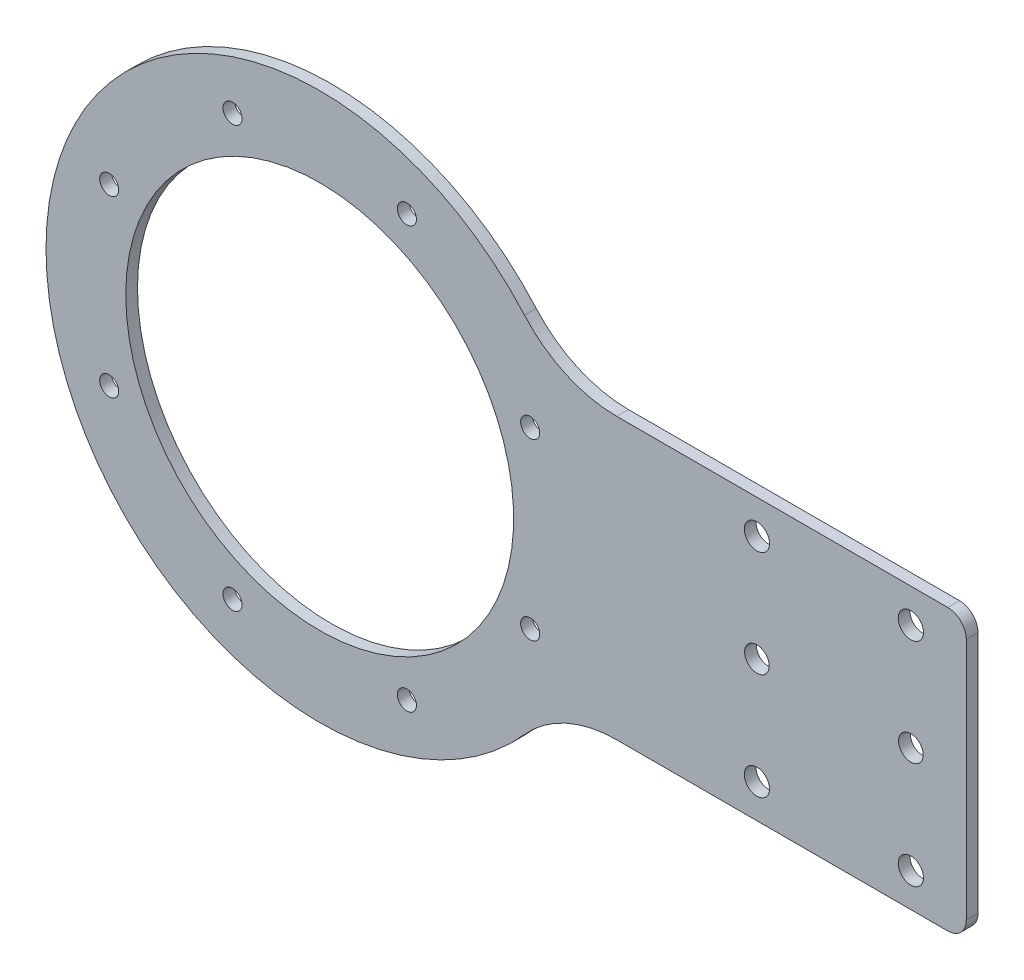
ISO-10303-21;
HEADER;
FILE_DESCRIPTION(('STEP AP214'),'2;1');
FILE_NAME('part.step','',(''),(''),'','','');
FILE_SCHEMA(('AUTOMOTIVE_DESIGN { 1 0 10303 214 1 1 1 1 }'));
ENDSEC;
DATA;
#1=APPLICATION_CONTEXT('core data for automotive mechanical design processes');
#2=APPLICATION_PROTOCOL_DEFINITION('international standard','automotive_design',2000,#1);
#3=PRODUCT_CONTEXT('',#1,'mechanical');
#4=PRODUCT('Part','Part','',(#3));
#5=PRODUCT_RELATED_PRODUCT_CATEGORY('part','',(#4));
#6=PRODUCT_DEFINITION_FORMATION('','',#4);
#7=PRODUCT_DEFINITION_CONTEXT('part definition',#1,'design');
#8=PRODUCT_DEFINITION('design','',#6,#7);
#9=PRODUCT_DEFINITION_SHAPE('','',#8);
#10=(LENGTH_UNIT() NAMED_UNIT(*) SI_UNIT(.MILLI.,.METRE.));
#11=(NAMED_UNIT(*) PLANE_ANGLE_UNIT() SI_UNIT($,.RADIAN.));
#12=(NAMED_UNIT(*) SI_UNIT($,.STERADIAN.) SOLID_ANGLE_UNIT());
#13=UNCERTAINTY_MEASURE_WITH_UNIT(LENGTH_MEASURE(1.E-05),#10,'distance_accuracy_value','');
#14=(GEOMETRIC_REPRESENTATION_CONTEXT(3) GLOBAL_UNCERTAINTY_ASSIGNED_CONTEXT((#13)) GLOBAL_UNIT_ASSIGNED_CONTEXT((#10,
#11,#12)) REPRESENTATION_CONTEXT('',''));
#15=CARTESIAN_POINT('',(0.,0.,0.));
#16=DIRECTION('',(0.,0.,1.));
#17=DIRECTION('',(1.,0.,0.));
#18=AXIS2_PLACEMENT_3D('',#15,#16,#17);
#19=CARTESIAN_POINT('',(0.,0.,1.905));
#20=DIRECTION('',(0.,0.,1.));
#21=DIRECTION('',(1.,0.,0.));
#22=AXIS2_PLACEMENT_3D('',#19,#20,#21);
#23=PLANE('',#22);
#24=CARTESIAN_POINT('',(71.,0.,1.905));
#25=DIRECTION('',(0.,0.,1.));
#26=DIRECTION('',(1.,0.,0.));
#27=AXIS2_PLACEMENT_3D('',#24,#25,#26);
#28=CIRCLE('',#27,2.);
#29=CARTESIAN_POINT('',(73.,0.,1.905));
#30=VERTEX_POINT('',#29);
#31=EDGE_CURVE('E335',#30,#30,#28,.T.);
#32=ORIENTED_EDGE('',*,*,#31,.F.);
#33=EDGE_LOOP('',(#32));
#34=FACE_BOUND('',#33,.T.);
#35=CARTESIAN_POINT('',(96.,0.,1.905));
#36=DIRECTION('',(0.,0.,1.));
#37=DIRECTION('',(1.,0.,0.));
#38=AXIS2_PLACEMENT_3D('',#35,#36,#37);
#39=CIRCLE('',#38,2.);
#40=CARTESIAN_POINT('',(98.,0.,1.905));
#41=VERTEX_POINT('',#40);
#42=EDGE_CURVE('E328',#41,#41,#39,.T.);
#43=ORIENTED_EDGE('',*,*,#42,.F.);
#44=EDGE_LOOP('',(#43));
#45=FACE_BOUND('',#44,.T.);
#46=CARTESIAN_POINT('',(34.1835427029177,-14.1592869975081,1.905));
#47=DIRECTION('',(0.,0.,1.));
#48=DIRECTION('',(1.,0.,0.));
#49=AXIS2_PLACEMENT_3D('',#46,#47,#48);
#50=CIRCLE('',#49,1.55);
#51=CARTESIAN_POINT('',(32.6335427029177,-14.1592869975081,1.905));
#52=VERTEX_POINT('',#51);
#53=EDGE_CURVE('E302',#52,#52,#50,.T.);
#54=ORIENTED_EDGE('',*,*,#53,.F.);
#55=EDGE_LOOP('',(#54));
#56=FACE_BOUND('',#55,.T.);
#57=CARTESIAN_POINT('',(14.1592869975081,34.1835427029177,1.905));
#58=DIRECTION('',(0.,0.,1.));
#59=DIRECTION('',(1.,0.,0.));
#60=AXIS2_PLACEMENT_3D('',#57,#58,#59);
#61=CIRCLE('',#60,1.55);
#62=CARTESIAN_POINT('',(12.6092869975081,34.1835427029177,1.905));
#63=VERTEX_POINT('',#62);
#64=EDGE_CURVE('E288',#63,#63,#61,.T.);
#65=ORIENTED_EDGE('',*,*,#64,.F.);
#66=EDGE_LOOP('',(#65));
#67=FACE_BOUND('',#66,.T.);
#68=CARTESIAN_POINT('',(-34.1835427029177,14.1592869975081,1.905));
#69=DIRECTION('',(0.,0.,1.));
#70=DIRECTION('',(1.,0.,0.));
#71=AXIS2_PLACEMENT_3D('',#68,#69,#70);
#72=CIRCLE('',#71,1.55);
#73=CARTESIAN_POINT('',(-35.7335427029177,14.1592869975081,1.905));
#74=VERTEX_POINT('',#73);
#75=EDGE_CURVE('E275',#74,#74,#72,.T.);
#76=ORIENTED_EDGE('',*,*,#75,.F.);
#77=EDGE_LOOP('',(#76));
#78=FACE_BOUND('',#77,.T.);
#79=CARTESIAN_POINT('',(-14.1592869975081,-34.1835427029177,1.905));
#80=DIRECTION('',(0.,0.,1.));
#81=DIRECTION('',(1.,0.,0.));
#82=AXIS2_PLACEMENT_3D('',#79,#80,#81);
#83=CIRCLE('',#82,1.55);
#84=CARTESIAN_POINT('',(-15.7092869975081,-34.1835427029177,1.905));
#85=VERTEX_POINT('',#84);
#86=EDGE_CURVE('E256',#85,#85,#83,.T.);
#87=ORIENTED_EDGE('',*,*,#86,.F.);
#88=EDGE_LOOP('',(#87));
#89=FACE_BOUND('',#88,.T.);
#90=CARTESIAN_POINT('',(71.,17.25,1.905));
#91=DIRECTION('',(0.,0.,1.));
#92=DIRECTION('',(1.,0.,0.));
#93=AXIS2_PLACEMENT_3D('',#90,#91,#92);
#94=CIRCLE('',#93,2.05);
#95=CARTESIAN_POINT('',(68.95,17.25,1.905));
#96=VERTEX_POINT('',#95);
#97=EDGE_CURVE('E239',#96,#96,#94,.T.);
#98=ORIENTED_EDGE('',*,*,#97,.F.);
#99=EDGE_LOOP('',(#98));
#100=FACE_BOUND('',#99,.T.);
#101=CARTESIAN_POINT('',(96.,17.25,1.905));
#102=DIRECTION('',(0.,0.,1.));
#103=DIRECTION('',(1.,0.,0.));
#104=AXIS2_PLACEMENT_3D('',#101,#102,#103);
#105=CIRCLE('',#104,2.05);
#106=CARTESIAN_POINT('',(93.95,17.25,1.905));
#107=VERTEX_POINT('',#106);
#108=EDGE_CURVE('E222',#107,#107,#105,.T.);
#109=ORIENTED_EDGE('',*,*,#108,.F.);
#110=EDGE_LOOP('',(#109));
#111=FACE_BOUND('',#110,.T.);
#112=DIRECTION('',(0.,1.,0.));
#113=VECTOR('',#112,1.);
#114=CARTESIAN_POINT('',(105.,-22.75,1.905));
#115=LINE('',#114,#113);
#116=CARTESIAN_POINT('',(105.,-19.75,1.905));
#117=VERTEX_POINT('',#116);
#118=CARTESIAN_POINT('',(105.,19.75,1.905));
#119=VERTEX_POINT('',#118);
#120=EDGE_CURVE('E157',#117,#119,#115,.T.);
#121=ORIENTED_EDGE('',*,*,#120,.T.);
#122=CARTESIAN_POINT('',(102.,19.75,1.905));
#123=DIRECTION('',(0.,0.,1.));
#124=DIRECTION('',(1.,0.,0.));
#125=AXIS2_PLACEMENT_3D('',#122,#123,#124);
#126=CIRCLE('',#125,3.);
#127=CARTESIAN_POINT('',(102.,22.75,1.905));
#128=VERTEX_POINT('',#127);
#129=EDGE_CURVE('E53',#119,#128,#126,.T.);
#130=ORIENTED_EDGE('',*,*,#129,.T.);
#131=DIRECTION('',(-1.,0.,0.));
#132=VECTOR('',#131,1.);
#133=CARTESIAN_POINT('',(38.1869087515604,22.75,1.905));
#134=LINE('',#133,#132);
#135=CARTESIAN_POINT('',(48.2311102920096,22.75,1.905));
#136=VERTEX_POINT('',#135);
#137=EDGE_CURVE('E160',#128,#136,#134,.T.);
#138=ORIENTED_EDGE('',*,*,#137,.T.);
#139=CARTESIAN_POINT('',(48.2311102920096,42.75,1.905));
#140=DIRECTION('',(0.,0.,1.));
#141=DIRECTION('',(1.,0.,0.));
#142=AXIS2_PLACEMENT_3D('',#139,#140,#141);
#143=CIRCLE('',#142,20.);
#144=CARTESIAN_POINT('',(33.2641249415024,29.483902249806,1.905));
#145=VERTEX_POINT('',#144);
#146=EDGE_CURVE('E123',#136,#145,#143,.F.);
#147=ORIENTED_EDGE('',*,*,#146,.T.);
#148=CARTESIAN_POINT('',(0.,0.,1.905));
#149=DIRECTION('',(0.,0.,1.));
#150=DIRECTION('',(1.,0.,0.));
#151=AXIS2_PLACEMENT_3D('',#148,#149,#150);
#152=CIRCLE('',#151,44.45);
#153=CARTESIAN_POINT('',(33.2641249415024,-29.483902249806,1.905));
#154=VERTEX_POINT('',#153);
#155=EDGE_CURVE('E134',#145,#154,#152,.T.);
#156=ORIENTED_EDGE('',*,*,#155,.T.);
#157=CARTESIAN_POINT('',(48.2311102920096,-42.75,1.905));
#158=DIRECTION('',(0.,0.,1.));
#159=DIRECTION('',(1.,0.,0.));
#160=AXIS2_PLACEMENT_3D('',#157,#158,#159);
#161=CIRCLE('',#160,20.);
#162=CARTESIAN_POINT('',(48.2311102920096,-22.75,1.905));
#163=VERTEX_POINT('',#162);
#164=EDGE_CURVE('E167',#154,#163,#161,.F.);
#165=ORIENTED_EDGE('',*,*,#164,.T.);
#166=DIRECTION('',(1.,0.,0.));
#167=VECTOR('',#166,1.);
#168=CARTESIAN_POINT('',(38.1869087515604,-22.75,1.905));
#169=LINE('',#168,#167);
#170=CARTESIAN_POINT('',(102.,-22.75,1.905));
#171=VERTEX_POINT('',#170);
#172=EDGE_CURVE('E208',#163,#171,#169,.T.);
#173=ORIENTED_EDGE('',*,*,#172,.T.);
#174=CARTESIAN_POINT('',(102.,-19.75,1.905));
#175=DIRECTION('',(0.,0.,1.));
#176=DIRECTION('',(1.,0.,0.));
#177=AXIS2_PLACEMENT_3D('',#174,#175,#176);
#178=CIRCLE('',#177,3.);
#179=EDGE_CURVE('E186',#171,#117,#178,.T.);
#180=ORIENTED_EDGE('',*,*,#179,.T.);
#181=EDGE_LOOP('',(#121,#130,#138,#147,#156,#165,#173,#180));
#182=FACE_BOUND('',#181,.T.);
#183=CARTESIAN_POINT('',(96.,-17.25,1.905));
#184=DIRECTION('',(0.,0.,1.));
#185=DIRECTION('',(1.,0.,0.));
#186=AXIS2_PLACEMENT_3D('',#183,#184,#185);
#187=CIRCLE('',#186,2.05);
#188=CARTESIAN_POINT('',(93.95,-17.25,1.905));
#189=VERTEX_POINT('',#188);
#190=EDGE_CURVE('E151',#189,#189,#187,.T.);
#191=ORIENTED_EDGE('',*,*,#190,.F.);
#192=EDGE_LOOP('',(#191));
#193=FACE_BOUND('',#192,.T.);
#194=CARTESIAN_POINT('',(71.,-17.25,1.905));
#195=DIRECTION('',(0.,0.,1.));
#196=DIRECTION('',(1.,0.,0.));
#197=AXIS2_PLACEMENT_3D('',#194,#195,#196);
#198=CIRCLE('',#197,2.05);
#199=CARTESIAN_POINT('',(68.95,-17.25,1.905));
#200=VERTEX_POINT('',#199);
#201=EDGE_CURVE('E235',#200,#200,#198,.T.);
#202=ORIENTED_EDGE('',*,*,#201,.F.);
#203=EDGE_LOOP('',(#202));
#204=FACE_BOUND('',#203,.T.);
#205=CARTESIAN_POINT('',(0.,0.,1.905));
#206=DIRECTION('',(0.,0.,1.));
#207=DIRECTION('',(1.,0.,0.));
#208=AXIS2_PLACEMENT_3D('',#205,#206,#207);
#209=CIRCLE('',#208,31.5);
#210=CARTESIAN_POINT('',(-31.5,0.,1.905));
#211=VERTEX_POINT('',#210);
#212=EDGE_CURVE('E247',#211,#211,#209,.T.);
#213=ORIENTED_EDGE('',*,*,#212,.F.);
#214=EDGE_LOOP('',(#213));
#215=FACE_BOUND('',#214,.T.);
#216=CARTESIAN_POINT('',(-34.1835427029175,-14.1592869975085,1.905));
#217=DIRECTION('',(0.,0.,1.));
#218=DIRECTION('',(1.,0.,0.));
#219=AXIS2_PLACEMENT_3D('',#216,#217,#218);
#220=CIRCLE('',#219,1.55);
#221=CARTESIAN_POINT('',(-35.7335427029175,-14.1592869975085,1.905));
#222=VERTEX_POINT('',#221);
#223=EDGE_CURVE('E262',#222,#222,#220,.T.);
#224=ORIENTED_EDGE('',*,*,#223,.F.);
#225=EDGE_LOOP('',(#224));
#226=FACE_BOUND('',#225,.T.);
#227=CARTESIAN_POINT('',(-14.1592869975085,34.1835427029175,1.905));
#228=DIRECTION('',(0.,0.,1.));
#229=DIRECTION('',(1.,0.,0.));
#230=AXIS2_PLACEMENT_3D('',#227,#228,#229);
#231=CIRCLE('',#230,1.55);
#232=CARTESIAN_POINT('',(-15.7092869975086,34.1835427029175,1.905));
#233=VERTEX_POINT('',#232);
#234=EDGE_CURVE('E279',#233,#233,#231,.T.);
#235=ORIENTED_EDGE('',*,*,#234,.F.);
#236=EDGE_LOOP('',(#235));
#237=FACE_BOUND('',#236,.T.);
#238=CARTESIAN_POINT('',(34.1835427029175,14.1592869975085,1.905));
#239=DIRECTION('',(0.,0.,1.));
#240=DIRECTION('',(1.,0.,0.));
#241=AXIS2_PLACEMENT_3D('',#238,#239,#240);
#242=CIRCLE('',#241,1.55);
#243=CARTESIAN_POINT('',(32.6335427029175,14.1592869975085,1.905));
#244=VERTEX_POINT('',#243);
#245=EDGE_CURVE('E298',#244,#244,#242,.T.);
#246=ORIENTED_EDGE('',*,*,#245,.F.);
#247=EDGE_LOOP('',(#246));
#248=FACE_BOUND('',#247,.T.);
#249=CARTESIAN_POINT('',(14.1592869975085,-34.1835427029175,1.905));
#250=DIRECTION('',(0.,0.,1.));
#251=DIRECTION('',(1.,0.,0.));
#252=AXIS2_PLACEMENT_3D('',#249,#250,#251);
#253=CIRCLE('',#252,1.55);
#254=CARTESIAN_POINT('',(12.6092869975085,-34.1835427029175,1.905));
#255=VERTEX_POINT('',#254);
#256=EDGE_CURVE('E315',#255,#255,#253,.T.);
#257=ORIENTED_EDGE('',*,*,#256,.F.);
#258=EDGE_LOOP('',(#257));
#259=FACE_BOUND('',#258,.T.);
#260=ADVANCED_FACE('F44',(#34,#45,#56,#67,#78,#89,#100,#111,#182,#193,#204,#215,#226,#237,#248,
#259),#23,.T.);
#261=CARTESIAN_POINT('',(0.,0.,0.));
#262=DIRECTION('',(0.,0.,1.));
#263=DIRECTION('',(1.,0.,0.));
#264=AXIS2_PLACEMENT_3D('',#261,#262,#263);
#265=PLANE('',#264);
#266=CARTESIAN_POINT('',(71.,0.,0.));
#267=DIRECTION('',(0.,0.,1.));
#268=DIRECTION('',(1.,0.,0.));
#269=AXIS2_PLACEMENT_3D('',#266,#267,#268);
#270=CIRCLE('',#269,2.);
#271=CARTESIAN_POINT('',(73.,0.,0.));
#272=VERTEX_POINT('',#271);
#273=EDGE_CURVE('E318',#272,#272,#270,.T.);
#274=ORIENTED_EDGE('',*,*,#273,.T.);
#275=EDGE_LOOP('',(#274));
#276=FACE_BOUND('',#275,.T.);
#277=CARTESIAN_POINT('',(96.,0.,0.));
#278=DIRECTION('',(0.,0.,1.));
#279=DIRECTION('',(1.,0.,0.));
#280=AXIS2_PLACEMENT_3D('',#277,#278,#279);
#281=CIRCLE('',#280,2.);
#282=CARTESIAN_POINT('',(98.,0.,0.));
#283=VERTEX_POINT('',#282);
#284=EDGE_CURVE('E323',#283,#283,#281,.T.);
#285=ORIENTED_EDGE('',*,*,#284,.T.);
#286=EDGE_LOOP('',(#285));
#287=FACE_BOUND('',#286,.T.);
#288=DIRECTION('',(-1.,0.,0.));
#289=VECTOR('',#288,1.);
#290=CARTESIAN_POINT('',(38.1869087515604,22.75,0.));
#291=LINE('',#290,#289);
#292=CARTESIAN_POINT('',(102.,22.75,0.));
#293=VERTEX_POINT('',#292);
#294=CARTESIAN_POINT('',(48.2311102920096,22.75,0.));
#295=VERTEX_POINT('',#294);
#296=EDGE_CURVE('E143',#293,#295,#291,.T.);
#297=ORIENTED_EDGE('',*,*,#296,.F.);
#298=CARTESIAN_POINT('',(102.,19.75,0.));
#299=DIRECTION('',(0.,0.,1.));
#300=DIRECTION('',(1.,0.,0.));
#301=AXIS2_PLACEMENT_3D('',#298,#299,#300);
#302=CIRCLE('',#301,3.);
#303=CARTESIAN_POINT('',(105.,19.75,0.));
#304=VERTEX_POINT('',#303);
#305=EDGE_CURVE('E179',#293,#304,#302,.F.);
#306=ORIENTED_EDGE('',*,*,#305,.T.);
#307=DIRECTION('',(0.,1.,0.));
#308=VECTOR('',#307,1.);
#309=CARTESIAN_POINT('',(105.,-22.75,0.));
#310=LINE('',#309,#308);
#311=CARTESIAN_POINT('',(105.,-19.75,0.));
#312=VERTEX_POINT('',#311);
#313=EDGE_CURVE('E148',#312,#304,#310,.T.);
#314=ORIENTED_EDGE('',*,*,#313,.F.);
#315=CARTESIAN_POINT('',(102.,-19.75,0.));
#316=DIRECTION('',(0.,0.,1.));
#317=DIRECTION('',(1.,0.,0.));
#318=AXIS2_PLACEMENT_3D('',#315,#316,#317);
#319=CIRCLE('',#318,3.);
#320=CARTESIAN_POINT('',(102.,-22.75,0.));
#321=VERTEX_POINT('',#320);
#322=EDGE_CURVE('E180',#312,#321,#319,.F.);
#323=ORIENTED_EDGE('',*,*,#322,.T.);
#324=DIRECTION('',(1.,0.,0.));
#325=VECTOR('',#324,1.);
#326=CARTESIAN_POINT('',(38.1869087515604,-22.75,0.));
#327=LINE('',#326,#325);
#328=CARTESIAN_POINT('',(48.2311102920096,-22.75,0.));
#329=VERTEX_POINT('',#328);
#330=EDGE_CURVE('E144',#329,#321,#327,.T.);
#331=ORIENTED_EDGE('',*,*,#330,.F.);
#332=CARTESIAN_POINT('',(48.2311102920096,-42.75,0.));
#333=DIRECTION('',(0.,0.,1.));
#334=DIRECTION('',(1.,0.,0.));
#335=AXIS2_PLACEMENT_3D('',#332,#333,#334);
#336=CIRCLE('',#335,20.);
#337=CARTESIAN_POINT('',(33.2641249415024,-29.483902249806,0.));
#338=VERTEX_POINT('',#337);
#339=EDGE_CURVE('E145',#329,#338,#336,.T.);
#340=ORIENTED_EDGE('',*,*,#339,.T.);
#341=CARTESIAN_POINT('',(0.,0.,0.));
#342=DIRECTION('',(0.,0.,1.));
#343=DIRECTION('',(1.,0.,0.));
#344=AXIS2_PLACEMENT_3D('',#341,#342,#343);
#345=CIRCLE('',#344,44.45);
#346=CARTESIAN_POINT('',(33.2641249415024,29.483902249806,0.));
#347=VERTEX_POINT('',#346);
#348=EDGE_CURVE('E135',#347,#338,#345,.T.);
#349=ORIENTED_EDGE('',*,*,#348,.F.);
#350=CARTESIAN_POINT('',(48.2311102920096,42.75,0.));
#351=DIRECTION('',(0.,0.,1.));
#352=DIRECTION('',(1.,0.,0.));
#353=AXIS2_PLACEMENT_3D('',#350,#351,#352);
#354=CIRCLE('',#353,20.);
#355=EDGE_CURVE('E112',#347,#295,#354,.T.);
#356=ORIENTED_EDGE('',*,*,#355,.T.);
#357=EDGE_LOOP('',(#297,#306,#314,#323,#331,#340,#349,#356));
#358=FACE_BOUND('',#357,.T.);
#359=CARTESIAN_POINT('',(96.,-17.25,0.));
#360=DIRECTION('',(0.,0.,1.));
#361=DIRECTION('',(1.,0.,0.));
#362=AXIS2_PLACEMENT_3D('',#359,#360,#361);
#363=CIRCLE('',#362,2.05);
#364=CARTESIAN_POINT('',(93.95,-17.25,0.));
#365=VERTEX_POINT('',#364);
#366=EDGE_CURVE('E219',#365,#365,#363,.T.);
#367=ORIENTED_EDGE('',*,*,#366,.T.);
#368=EDGE_LOOP('',(#367));
#369=FACE_BOUND('',#368,.T.);
#370=CARTESIAN_POINT('',(96.,17.25,0.));
#371=DIRECTION('',(0.,0.,1.));
#372=DIRECTION('',(1.,0.,0.));
#373=AXIS2_PLACEMENT_3D('',#370,#371,#372);
#374=CIRCLE('',#373,2.05);
#375=CARTESIAN_POINT('',(93.95,17.25,0.));
#376=VERTEX_POINT('',#375);
#377=EDGE_CURVE('E226',#376,#376,#374,.T.);
#378=ORIENTED_EDGE('',*,*,#377,.T.);
#379=EDGE_LOOP('',(#378));
#380=FACE_BOUND('',#379,.T.);
#381=CARTESIAN_POINT('',(71.,-17.25,0.));
#382=DIRECTION('',(0.,0.,1.));
#383=DIRECTION('',(1.,0.,0.));
#384=AXIS2_PLACEMENT_3D('',#381,#382,#383);
#385=CIRCLE('',#384,2.05);
#386=CARTESIAN_POINT('',(68.95,-17.25,0.));
#387=VERTEX_POINT('',#386);
#388=EDGE_CURVE('E236',#387,#387,#385,.T.);
#389=ORIENTED_EDGE('',*,*,#388,.T.);
#390=EDGE_LOOP('',(#389));
#391=FACE_BOUND('',#390,.T.);
#392=CARTESIAN_POINT('',(71.,17.25,0.));
#393=DIRECTION('',(0.,0.,1.));
#394=DIRECTION('',(1.,0.,0.));
#395=AXIS2_PLACEMENT_3D('',#392,#393,#394);
#396=CIRCLE('',#395,2.05);
#397=CARTESIAN_POINT('',(68.95,17.25,0.));
#398=VERTEX_POINT('',#397);
#399=EDGE_CURVE('E242',#398,#398,#396,.T.);
#400=ORIENTED_EDGE('',*,*,#399,.T.);
#401=EDGE_LOOP('',(#400));
#402=FACE_BOUND('',#401,.T.);
#403=CARTESIAN_POINT('',(0.,0.,0.));
#404=DIRECTION('',(0.,0.,1.));
#405=DIRECTION('',(1.,0.,0.));
#406=AXIS2_PLACEMENT_3D('',#403,#404,#405);
#407=CIRCLE('',#406,31.5);
#408=CARTESIAN_POINT('',(-31.5,0.,0.));
#409=VERTEX_POINT('',#408);
#410=EDGE_CURVE('E255',#409,#409,#407,.T.);
#411=ORIENTED_EDGE('',*,*,#410,.T.);
#412=EDGE_LOOP('',(#411));
#413=FACE_BOUND('',#412,.T.);
#414=CARTESIAN_POINT('',(-14.1592869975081,-34.1835427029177,0.));
#415=DIRECTION('',(0.,0.,1.));
#416=DIRECTION('',(1.,0.,0.));
#417=AXIS2_PLACEMENT_3D('',#414,#415,#416);
#418=CIRCLE('',#417,1.55);
#419=CARTESIAN_POINT('',(-15.7092869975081,-34.1835427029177,0.));
#420=VERTEX_POINT('',#419);
#421=EDGE_CURVE('E259',#420,#420,#418,.T.);
#422=ORIENTED_EDGE('',*,*,#421,.T.);
#423=EDGE_LOOP('',(#422));
#424=FACE_BOUND('',#423,.T.);
#425=CARTESIAN_POINT('',(-34.1835427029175,-14.1592869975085,0.));
#426=DIRECTION('',(0.,0.,1.));
#427=DIRECTION('',(1.,0.,0.));
#428=AXIS2_PLACEMENT_3D('',#425,#426,#427);
#429=CIRCLE('',#428,1.55);
#430=CARTESIAN_POINT('',(-35.7335427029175,-14.1592869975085,0.));
#431=VERTEX_POINT('',#430);
#432=EDGE_CURVE('E268',#431,#431,#429,.T.);
#433=ORIENTED_EDGE('',*,*,#432,.T.);
#434=EDGE_LOOP('',(#433));
#435=FACE_BOUND('',#434,.T.);
#436=CARTESIAN_POINT('',(-34.1835427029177,14.1592869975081,0.));
#437=DIRECTION('',(0.,0.,1.));
#438=DIRECTION('',(1.,0.,0.));
#439=AXIS2_PLACEMENT_3D('',#436,#437,#438);
#440=CIRCLE('',#439,1.55);
#441=CARTESIAN_POINT('',(-35.7335427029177,14.1592869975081,0.));
#442=VERTEX_POINT('',#441);
#443=EDGE_CURVE('E276',#442,#442,#440,.T.);
#444=ORIENTED_EDGE('',*,*,#443,.T.);
#445=EDGE_LOOP('',(#444));
#446=FACE_BOUND('',#445,.T.);
#447=CARTESIAN_POINT('',(-14.1592869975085,34.1835427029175,0.));
#448=DIRECTION('',(0.,0.,1.));
#449=DIRECTION('',(1.,0.,0.));
#450=AXIS2_PLACEMENT_3D('',#447,#448,#449);
#451=CIRCLE('',#450,1.55);
#452=CARTESIAN_POINT('',(-15.7092869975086,34.1835427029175,0.));
#453=VERTEX_POINT('',#452);
#454=EDGE_CURVE('E282',#453,#453,#451,.T.);
#455=ORIENTED_EDGE('',*,*,#454,.T.);
#456=EDGE_LOOP('',(#455));
#457=FACE_BOUND('',#456,.T.);
#458=CARTESIAN_POINT('',(14.1592869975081,34.1835427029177,0.));
#459=DIRECTION('',(0.,0.,1.));
#460=DIRECTION('',(1.,0.,0.));
#461=AXIS2_PLACEMENT_3D('',#458,#459,#460);
#462=CIRCLE('',#461,1.55);
#463=CARTESIAN_POINT('',(12.6092869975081,34.1835427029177,0.));
#464=VERTEX_POINT('',#463);
#465=EDGE_CURVE('E292',#464,#464,#462,.T.);
#466=ORIENTED_EDGE('',*,*,#465,.T.);
#467=EDGE_LOOP('',(#466));
#468=FACE_BOUND('',#467,.T.);
#469=CARTESIAN_POINT('',(34.1835427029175,14.1592869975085,0.));
#470=DIRECTION('',(0.,0.,1.));
#471=DIRECTION('',(1.,0.,0.));
#472=AXIS2_PLACEMENT_3D('',#469,#470,#471);
#473=CIRCLE('',#472,1.55);
#474=CARTESIAN_POINT('',(32.6335427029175,14.1592869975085,0.));
#475=VERTEX_POINT('',#474);
#476=EDGE_CURVE('E297',#475,#475,#473,.T.);
#477=ORIENTED_EDGE('',*,*,#476,.T.);
#478=EDGE_LOOP('',(#477));
#479=FACE_BOUND('',#478,.T.);
#480=CARTESIAN_POINT('',(34.1835427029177,-14.1592869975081,0.));
#481=DIRECTION('',(0.,0.,1.));
#482=DIRECTION('',(1.,0.,0.));
#483=AXIS2_PLACEMENT_3D('',#480,#481,#482);
#484=CIRCLE('',#483,1.55);
#485=CARTESIAN_POINT('',(32.6335427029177,-14.1592869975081,0.));
#486=VERTEX_POINT('',#485);
#487=EDGE_CURVE('E308',#486,#486,#484,.T.);
#488=ORIENTED_EDGE('',*,*,#487,.T.);
#489=EDGE_LOOP('',(#488));
#490=FACE_BOUND('',#489,.T.);
#491=CARTESIAN_POINT('',(14.1592869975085,-34.1835427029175,0.));
#492=DIRECTION('',(0.,0.,1.));
#493=DIRECTION('',(1.,0.,0.));
#494=AXIS2_PLACEMENT_3D('',#491,#492,#493);
#495=CIRCLE('',#494,1.55);
#496=CARTESIAN_POINT('',(12.6092869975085,-34.1835427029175,0.));
#497=VERTEX_POINT('',#496);
#498=EDGE_CURVE('E317',#497,#497,#495,.T.);
#499=ORIENTED_EDGE('',*,*,#498,.T.);
#500=EDGE_LOOP('',(#499));
#501=FACE_BOUND('',#500,.T.);
#502=ADVANCED_FACE('F137',(#276,#287,#358,#369,#380,#391,#402,#413,#424,#435,#446,#457,#468,
#479,#490,#501),#265,.F.);
#503=CARTESIAN_POINT('',(38.1869087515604,22.75,1.905));
#504=DIRECTION('',(0.,-1.,0.));
#505=DIRECTION('',(1.,0.,0.));
#506=AXIS2_PLACEMENT_3D('',#503,#504,#505);
#507=PLANE('',#506);
#508=ORIENTED_EDGE('',*,*,#137,.F.);
#509=DIRECTION('',(0.,0.,-1.));
#510=VECTOR('',#509,1.);
#511=CARTESIAN_POINT('',(102.,22.75,1.905));
#512=LINE('',#511,#510);
#513=EDGE_CURVE('E173',#128,#293,#512,.T.);
#514=ORIENTED_EDGE('',*,*,#513,.T.);
#515=ORIENTED_EDGE('',*,*,#296,.T.);
#516=DIRECTION('',(0.,0.,1.));
#517=VECTOR('',#516,1.);
#518=CARTESIAN_POINT('',(48.2311102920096,22.75,1.905));
#519=LINE('',#518,#517);
#520=EDGE_CURVE('E119',#295,#136,#519,.T.);
#521=ORIENTED_EDGE('',*,*,#520,.T.);
#522=EDGE_LOOP('',(#508,#514,#515,#521));
#523=FACE_BOUND('',#522,.T.);
#524=ADVANCED_FACE('F197',(#523),#507,.F.);
#525=CARTESIAN_POINT('',(0.,0.,1.905));
#526=DIRECTION('',(0.,0.,-1.));
#527=DIRECTION('',(-1.,0.,0.));
#528=AXIS2_PLACEMENT_3D('',#525,#526,#527);
#529=CYLINDRICAL_SURFACE('',#528,44.45);
#530=ORIENTED_EDGE('',*,*,#155,.F.);
#531=DIRECTION('',(0.,0.,-1.));
#532=VECTOR('',#531,1.);
#533=CARTESIAN_POINT('',(33.2641249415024,29.483902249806,1.905));
#534=LINE('',#533,#532);
#535=EDGE_CURVE('E117',#145,#347,#534,.T.);
#536=ORIENTED_EDGE('',*,*,#535,.T.);
#537=ORIENTED_EDGE('',*,*,#348,.T.);
#538=DIRECTION('',(0.,0.,-1.));
#539=VECTOR('',#538,1.);
#540=CARTESIAN_POINT('',(33.2641249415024,-29.483902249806,1.905));
#541=LINE('',#540,#539);
#542=EDGE_CURVE('E140',#338,#154,#541,.F.);
#543=ORIENTED_EDGE('',*,*,#542,.T.);
#544=EDGE_LOOP('',(#530,#536,#537,#543));
#545=FACE_BOUND('',#544,.T.);
#546=ADVANCED_FACE('F131',(#545),#529,.T.);
#547=CARTESIAN_POINT('',(38.1869087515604,-22.75,1.905));
#548=DIRECTION('',(0.,1.,0.));
#549=DIRECTION('',(-1.,0.,0.));
#550=AXIS2_PLACEMENT_3D('',#547,#548,#549);
#551=PLANE('',#550);
#552=ORIENTED_EDGE('',*,*,#330,.T.);
#553=DIRECTION('',(0.,0.,-1.));
#554=VECTOR('',#553,1.);
#555=CARTESIAN_POINT('',(102.,-22.75,1.905));
#556=LINE('',#555,#554);
#557=EDGE_CURVE('E11',#321,#171,#556,.F.);
#558=ORIENTED_EDGE('',*,*,#557,.T.);
#559=ORIENTED_EDGE('',*,*,#172,.F.);
#560=DIRECTION('',(0.,0.,1.));
#561=VECTOR('',#560,1.);
#562=CARTESIAN_POINT('',(48.2311102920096,-22.75,0.));
#563=LINE('',#562,#561);
#564=EDGE_CURVE('E126',#163,#329,#563,.F.);
#565=ORIENTED_EDGE('',*,*,#564,.T.);
#566=EDGE_LOOP('',(#552,#558,#559,#565));
#567=FACE_BOUND('',#566,.T.);
#568=ADVANCED_FACE('F206',(#567),#551,.F.);
#569=CARTESIAN_POINT('',(105.,-22.75,1.905));
#570=DIRECTION('',(-1.,0.,0.));
#571=DIRECTION('',(0.,0.,1.));
#572=AXIS2_PLACEMENT_3D('',#569,#570,#571);
#573=PLANE('',#572);
#574=ORIENTED_EDGE('',*,*,#313,.T.);
#575=DIRECTION('',(0.,0.,-1.));
#576=VECTOR('',#575,1.);
#577=CARTESIAN_POINT('',(105.,19.75,1.905));
#578=LINE('',#577,#576);
#579=EDGE_CURVE('E70',#304,#119,#578,.F.);
#580=ORIENTED_EDGE('',*,*,#579,.T.);
#581=ORIENTED_EDGE('',*,*,#120,.F.);
#582=DIRECTION('',(0.,0.,-1.));
#583=VECTOR('',#582,1.);
#584=CARTESIAN_POINT('',(105.,-19.75,1.905));
#585=LINE('',#584,#583);
#586=EDGE_CURVE('E182',#117,#312,#585,.T.);
#587=ORIENTED_EDGE('',*,*,#586,.T.);
#588=EDGE_LOOP('',(#574,#580,#581,#587));
#589=FACE_BOUND('',#588,.T.);
#590=ADVANCED_FACE('F202',(#589),#573,.F.);
#591=CARTESIAN_POINT('',(96.,-17.25,1.905));
#592=DIRECTION('',(0.,0.,-1.));
#593=DIRECTION('',(-1.,0.,0.));
#594=AXIS2_PLACEMENT_3D('',#591,#592,#593);
#595=CYLINDRICAL_SURFACE('',#594,2.05);
#596=CARTESIAN_POINT('',(93.95,-17.25,1.905));
#597=CARTESIAN_POINT('',(93.95,-17.25,1.88515625));
#598=CARTESIAN_POINT('',(93.95,-17.25,1.8653125));
#599=CARTESIAN_POINT('',(93.95,-17.25,1.825625));
#600=CARTESIAN_POINT('',(93.95,-17.25,1.80578125));
#601=CARTESIAN_POINT('',(93.95,-17.25,1.76609375));
#602=CARTESIAN_POINT('',(93.95,-17.25,1.74625));
#603=CARTESIAN_POINT('',(93.95,-17.25,1.7065625));
#604=CARTESIAN_POINT('',(93.95,-17.25,1.68671875));
#605=CARTESIAN_POINT('',(93.95,-17.25,1.64703125));
#606=CARTESIAN_POINT('',(93.95,-17.25,1.6271875));
#607=CARTESIAN_POINT('',(93.95,-17.25,1.5875));
#608=CARTESIAN_POINT('',(93.95,-17.25,1.56765625));
#609=CARTESIAN_POINT('',(93.95,-17.25,1.52796875));
#610=CARTESIAN_POINT('',(93.95,-17.25,1.508125));
#611=CARTESIAN_POINT('',(93.95,-17.25,1.4684375));
#612=CARTESIAN_POINT('',(93.95,-17.25,1.44859375));
#613=CARTESIAN_POINT('',(93.95,-17.25,1.40890625));
#614=CARTESIAN_POINT('',(93.95,-17.25,1.3890625));
#615=CARTESIAN_POINT('',(93.95,-17.25,1.349375));
#616=CARTESIAN_POINT('',(93.95,-17.25,1.32953125));
#617=CARTESIAN_POINT('',(93.95,-17.25,1.28984375));
#618=CARTESIAN_POINT('',(93.95,-17.25,1.27));
#619=CARTESIAN_POINT('',(93.95,-17.25,1.2303125));
#620=CARTESIAN_POINT('',(93.95,-17.25,1.21046875));
#621=CARTESIAN_POINT('',(93.95,-17.25,1.17078125));
#622=CARTESIAN_POINT('',(93.95,-17.25,1.1509375));
#623=CARTESIAN_POINT('',(93.95,-17.25,1.11125));
#624=CARTESIAN_POINT('',(93.95,-17.25,1.09140625));
#625=CARTESIAN_POINT('',(93.95,-17.25,1.05171875));
#626=CARTESIAN_POINT('',(93.95,-17.25,1.031875));
#627=CARTESIAN_POINT('',(93.95,-17.25,0.9921875));
#628=CARTESIAN_POINT('',(93.95,-17.25,0.97234375));
#629=CARTESIAN_POINT('',(93.95,-17.25,0.93265625));
#630=CARTESIAN_POINT('',(93.95,-17.25,0.9128125));
#631=CARTESIAN_POINT('',(93.95,-17.25,0.873125));
#632=CARTESIAN_POINT('',(93.95,-17.25,0.85328125));
#633=CARTESIAN_POINT('',(93.95,-17.25,0.81359375));
#634=CARTESIAN_POINT('',(93.95,-17.25,0.79375));
#635=CARTESIAN_POINT('',(93.95,-17.25,0.7540625));
#636=CARTESIAN_POINT('',(93.95,-17.25,0.73421875));
#637=CARTESIAN_POINT('',(93.95,-17.25,0.69453125));
#638=CARTESIAN_POINT('',(93.95,-17.25,0.6746875));
#639=CARTESIAN_POINT('',(93.95,-17.25,0.635));
#640=CARTESIAN_POINT('',(93.95,-17.25,0.61515625));
#641=CARTESIAN_POINT('',(93.95,-17.25,0.57546875));
#642=CARTESIAN_POINT('',(93.95,-17.25,0.555625));
#643=CARTESIAN_POINT('',(93.95,-17.25,0.5159375));
#644=CARTESIAN_POINT('',(93.95,-17.25,0.49609375));
#645=CARTESIAN_POINT('',(93.95,-17.25,0.45640625));
#646=CARTESIAN_POINT('',(93.95,-17.25,0.4365625));
#647=CARTESIAN_POINT('',(93.95,-17.25,0.396875));
#648=CARTESIAN_POINT('',(93.95,-17.25,0.37703125));
#649=CARTESIAN_POINT('',(93.95,-17.25,0.33734375));
#650=CARTESIAN_POINT('',(93.95,-17.25,0.3175));
#651=CARTESIAN_POINT('',(93.95,-17.25,0.2778125));
#652=CARTESIAN_POINT('',(93.95,-17.25,0.25796875));
#653=CARTESIAN_POINT('',(93.95,-17.25,0.21828125));
#654=CARTESIAN_POINT('',(93.95,-17.25,0.1984375));
#655=CARTESIAN_POINT('',(93.95,-17.25,0.15875));
#656=CARTESIAN_POINT('',(93.95,-17.25,0.13890625));
#657=CARTESIAN_POINT('',(93.95,-17.25,0.09921875));
#658=CARTESIAN_POINT('',(93.95,-17.25,0.0793749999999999));
#659=CARTESIAN_POINT('',(93.95,-17.25,0.0396874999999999));
#660=CARTESIAN_POINT('',(93.95,-17.25,0.01984375));
#661=CARTESIAN_POINT('',(93.95,-17.25,0.));
#662=B_SPLINE_CURVE_WITH_KNOTS('',3,(#596,#597,#598,#599,#600,#601,#602,#603,#604,#605,#606,
#607,#608,#609,#610,#611,#612,#613,#614,#615,#616,#617,#618,#619,#620,#621,#622,#623,#624,#625,
#626,#627,#628,#629,#630,#631,#632,#633,#634,#635,#636,#637,#638,#639,#640,#641,#642,#643,#644,
#645,#646,#647,#648,#649,#650,#651,#652,#653,#654,#655,#656,#657,#658,#659,#660,#661),
.UNSPECIFIED.,.F.,.F.,(4,2,2,2,2,2,2,2,2,2,2,2,2,2,2,2,2,2,2,2,2,2,2,2,2,2,2,2,2,2,2,2,4),(0.,
0.0595312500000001,0.1190625,0.17859375,0.238125,0.29765625,0.3571875,0.41671875,0.47625,
0.53578125,0.5953125,0.65484375,0.714375,0.77390625,0.8334375,0.89296875,0.9525,1.01203125,
1.0715625,1.13109375,1.190625,1.25015625,1.3096875,1.36921875,1.42875,1.48828125,1.5478125,
1.60734375,1.666875,1.72640625,1.7859375,1.84546875,1.905),.UNSPECIFIED.);
#663=EDGE_CURVE('BSEAM369',#189,#365,#662,.T.);
#664=ORIENTED_EDGE('',*,*,#190,.T.);
#665=ORIENTED_EDGE('',*,*,#366,.F.);
#666=ORIENTED_EDGE('',*,*,#663,.T.);
#667=ORIENTED_EDGE('',*,*,#663,.F.);
#668=EDGE_LOOP('',(#664,#666,#665,#667));
#669=FACE_BOUND('',#668,.T.);
#670=ADVANCED_FACE('F369',(#669),#595,.F.);
#671=CARTESIAN_POINT('',(96.,17.25,1.905));
#672=DIRECTION('',(0.,0.,-1.));
#673=DIRECTION('',(-1.,0.,0.));
#674=AXIS2_PLACEMENT_3D('',#671,#672,#673);
#675=CYLINDRICAL_SURFACE('',#674,2.05);
#676=CARTESIAN_POINT('',(93.95,17.25,1.905));
#677=CARTESIAN_POINT('',(93.95,17.25,1.88515625));
#678=CARTESIAN_POINT('',(93.95,17.25,1.8653125));
#679=CARTESIAN_POINT('',(93.95,17.25,1.825625));
#680=CARTESIAN_POINT('',(93.95,17.25,1.80578125));
#681=CARTESIAN_POINT('',(93.95,17.25,1.76609375));
#682=CARTESIAN_POINT('',(93.95,17.25,1.74625));
#683=CARTESIAN_POINT('',(93.95,17.25,1.7065625));
#684=CARTESIAN_POINT('',(93.95,17.25,1.68671875));
#685=CARTESIAN_POINT('',(93.95,17.25,1.64703125));
#686=CARTESIAN_POINT('',(93.95,17.25,1.6271875));
#687=CARTESIAN_POINT('',(93.95,17.25,1.5875));
#688=CARTESIAN_POINT('',(93.95,17.25,1.56765625));
#689=CARTESIAN_POINT('',(93.95,17.25,1.52796875));
#690=CARTESIAN_POINT('',(93.95,17.25,1.508125));
#691=CARTESIAN_POINT('',(93.95,17.25,1.4684375));
#692=CARTESIAN_POINT('',(93.95,17.25,1.44859375));
#693=CARTESIAN_POINT('',(93.95,17.25,1.40890625));
#694=CARTESIAN_POINT('',(93.95,17.25,1.3890625));
#695=CARTESIAN_POINT('',(93.95,17.25,1.349375));
#696=CARTESIAN_POINT('',(93.95,17.25,1.32953125));
#697=CARTESIAN_POINT('',(93.95,17.25,1.28984375));
#698=CARTESIAN_POINT('',(93.95,17.25,1.27));
#699=CARTESIAN_POINT('',(93.95,17.25,1.2303125));
#700=CARTESIAN_POINT('',(93.95,17.25,1.21046875));
#701=CARTESIAN_POINT('',(93.95,17.25,1.17078125));
#702=CARTESIAN_POINT('',(93.95,17.25,1.1509375));
#703=CARTESIAN_POINT('',(93.95,17.25,1.11125));
#704=CARTESIAN_POINT('',(93.95,17.25,1.09140625));
#705=CARTESIAN_POINT('',(93.95,17.25,1.05171875));
#706=CARTESIAN_POINT('',(93.95,17.25,1.031875));
#707=CARTESIAN_POINT('',(93.95,17.25,0.9921875));
#708=CARTESIAN_POINT('',(93.95,17.25,0.97234375));
#709=CARTESIAN_POINT('',(93.95,17.25,0.93265625));
#710=CARTESIAN_POINT('',(93.95,17.25,0.9128125));
#711=CARTESIAN_POINT('',(93.95,17.25,0.873125));
#712=CARTESIAN_POINT('',(93.95,17.25,0.85328125));
#713=CARTESIAN_POINT('',(93.95,17.25,0.81359375));
#714=CARTESIAN_POINT('',(93.95,17.25,0.79375));
#715=CARTESIAN_POINT('',(93.95,17.25,0.7540625));
#716=CARTESIAN_POINT('',(93.95,17.25,0.73421875));
#717=CARTESIAN_POINT('',(93.95,17.25,0.69453125));
#718=CARTESIAN_POINT('',(93.95,17.25,0.6746875));
#719=CARTESIAN_POINT('',(93.95,17.25,0.635));
#720=CARTESIAN_POINT('',(93.95,17.25,0.61515625));
#721=CARTESIAN_POINT('',(93.95,17.25,0.57546875));
#722=CARTESIAN_POINT('',(93.95,17.25,0.555625));
#723=CARTESIAN_POINT('',(93.95,17.25,0.5159375));
#724=CARTESIAN_POINT('',(93.95,17.25,0.49609375));
#725=CARTESIAN_POINT('',(93.95,17.25,0.45640625));
#726=CARTESIAN_POINT('',(93.95,17.25,0.4365625));
#727=CARTESIAN_POINT('',(93.95,17.25,0.396875));
#728=CARTESIAN_POINT('',(93.95,17.25,0.37703125));
#729=CARTESIAN_POINT('',(93.95,17.25,0.33734375));
#730=CARTESIAN_POINT('',(93.95,17.25,0.3175));
#731=CARTESIAN_POINT('',(93.95,17.25,0.2778125));
#732=CARTESIAN_POINT('',(93.95,17.25,0.25796875));
#733=CARTESIAN_POINT('',(93.95,17.25,0.21828125));
#734=CARTESIAN_POINT('',(93.95,17.25,0.1984375));
#735=CARTESIAN_POINT('',(93.95,17.25,0.15875));
#736=CARTESIAN_POINT('',(93.95,17.25,0.13890625));
#737=CARTESIAN_POINT('',(93.95,17.25,0.09921875));
#738=CARTESIAN_POINT('',(93.95,17.25,0.0793749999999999));
#739=CARTESIAN_POINT('',(93.95,17.25,0.0396874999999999));
#740=CARTESIAN_POINT('',(93.95,17.25,0.01984375));
#741=CARTESIAN_POINT('',(93.95,17.25,0.));
#742=B_SPLINE_CURVE_WITH_KNOTS('',3,(#676,#677,#678,#679,#680,#681,#682,#683,#684,#685,#686,
#687,#688,#689,#690,#691,#692,#693,#694,#695,#696,#697,#698,#699,#700,#701,#702,#703,#704,#705,
#706,#707,#708,#709,#710,#711,#712,#713,#714,#715,#716,#717,#718,#719,#720,#721,#722,#723,#724,
#725,#726,#727,#728,#729,#730,#731,#732,#733,#734,#735,#736,#737,#738,#739,#740,#741),
.UNSPECIFIED.,.F.,.F.,(4,2,2,2,2,2,2,2,2,2,2,2,2,2,2,2,2,2,2,2,2,2,2,2,2,2,2,2,2,2,2,2,4),(0.,
0.0595312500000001,0.1190625,0.17859375,0.238125,0.29765625,0.3571875,0.41671875,0.47625,
0.53578125,0.5953125,0.65484375,0.714375,0.77390625,0.8334375,0.89296875,0.9525,1.01203125,
1.0715625,1.13109375,1.190625,1.25015625,1.3096875,1.36921875,1.42875,1.48828125,1.5478125,
1.60734375,1.666875,1.72640625,1.7859375,1.84546875,1.905),.UNSPECIFIED.);
#743=EDGE_CURVE('BSEAM366',#107,#376,#742,.T.);
#744=ORIENTED_EDGE('',*,*,#108,.T.);
#745=ORIENTED_EDGE('',*,*,#377,.F.);
#746=ORIENTED_EDGE('',*,*,#743,.T.);
#747=ORIENTED_EDGE('',*,*,#743,.F.);
#748=EDGE_LOOP('',(#744,#746,#745,#747));
#749=FACE_BOUND('',#748,.T.);
#750=ADVANCED_FACE('F366',(#749),#675,.F.);
#751=CARTESIAN_POINT('',(71.,-17.25,1.905));
#752=DIRECTION('',(0.,0.,-1.));
#753=DIRECTION('',(-1.,0.,0.));
#754=AXIS2_PLACEMENT_3D('',#751,#752,#753);
#755=CYLINDRICAL_SURFACE('',#754,2.05);
#756=CARTESIAN_POINT('',(68.95,-17.25,1.905));
#757=CARTESIAN_POINT('',(68.95,-17.25,1.88515625));
#758=CARTESIAN_POINT('',(68.95,-17.25,1.8653125));
#759=CARTESIAN_POINT('',(68.95,-17.25,1.825625));
#760=CARTESIAN_POINT('',(68.95,-17.25,1.80578125));
#761=CARTESIAN_POINT('',(68.95,-17.25,1.76609375));
#762=CARTESIAN_POINT('',(68.95,-17.25,1.74625));
#763=CARTESIAN_POINT('',(68.95,-17.25,1.7065625));
#764=CARTESIAN_POINT('',(68.95,-17.25,1.68671875));
#765=CARTESIAN_POINT('',(68.95,-17.25,1.64703125));
#766=CARTESIAN_POINT('',(68.95,-17.25,1.6271875));
#767=CARTESIAN_POINT('',(68.95,-17.25,1.5875));
#768=CARTESIAN_POINT('',(68.95,-17.25,1.56765625));
#769=CARTESIAN_POINT('',(68.95,-17.25,1.52796875));
#770=CARTESIAN_POINT('',(68.95,-17.25,1.508125));
#771=CARTESIAN_POINT('',(68.95,-17.25,1.4684375));
#772=CARTESIAN_POINT('',(68.95,-17.25,1.44859375));
#773=CARTESIAN_POINT('',(68.95,-17.25,1.40890625));
#774=CARTESIAN_POINT('',(68.95,-17.25,1.3890625));
#775=CARTESIAN_POINT('',(68.95,-17.25,1.349375));
#776=CARTESIAN_POINT('',(68.95,-17.25,1.32953125));
#777=CARTESIAN_POINT('',(68.95,-17.25,1.28984375));
#778=CARTESIAN_POINT('',(68.95,-17.25,1.27));
#779=CARTESIAN_POINT('',(68.95,-17.25,1.2303125));
#780=CARTESIAN_POINT('',(68.95,-17.25,1.21046875));
#781=CARTESIAN_POINT('',(68.95,-17.25,1.17078125));
#782=CARTESIAN_POINT('',(68.95,-17.25,1.1509375));
#783=CARTESIAN_POINT('',(68.95,-17.25,1.11125));
#784=CARTESIAN_POINT('',(68.95,-17.25,1.09140625));
#785=CARTESIAN_POINT('',(68.95,-17.25,1.05171875));
#786=CARTESIAN_POINT('',(68.95,-17.25,1.031875));
#787=CARTESIAN_POINT('',(68.95,-17.25,0.9921875));
#788=CARTESIAN_POINT('',(68.95,-17.25,0.97234375));
#789=CARTESIAN_POINT('',(68.95,-17.25,0.93265625));
#790=CARTESIAN_POINT('',(68.95,-17.25,0.9128125));
#791=CARTESIAN_POINT('',(68.95,-17.25,0.873125));
#792=CARTESIAN_POINT('',(68.95,-17.25,0.85328125));
#793=CARTESIAN_POINT('',(68.95,-17.25,0.81359375));
#794=CARTESIAN_POINT('',(68.95,-17.25,0.79375));
#795=CARTESIAN_POINT('',(68.95,-17.25,0.7540625));
#796=CARTESIAN_POINT('',(68.95,-17.25,0.73421875));
#797=CARTESIAN_POINT('',(68.95,-17.25,0.69453125));
#798=CARTESIAN_POINT('',(68.95,-17.25,0.6746875));
#799=CARTESIAN_POINT('',(68.95,-17.25,0.635));
#800=CARTESIAN_POINT('',(68.95,-17.25,0.61515625));
#801=CARTESIAN_POINT('',(68.95,-17.25,0.57546875));
#802=CARTESIAN_POINT('',(68.95,-17.25,0.555625));
#803=CARTESIAN_POINT('',(68.95,-17.25,0.5159375));
#804=CARTESIAN_POINT('',(68.95,-17.25,0.49609375));
#805=CARTESIAN_POINT('',(68.95,-17.25,0.45640625));
#806=CARTESIAN_POINT('',(68.95,-17.25,0.4365625));
#807=CARTESIAN_POINT('',(68.95,-17.25,0.396875));
#808=CARTESIAN_POINT('',(68.95,-17.25,0.37703125));
#809=CARTESIAN_POINT('',(68.95,-17.25,0.33734375));
#810=CARTESIAN_POINT('',(68.95,-17.25,0.3175));
#811=CARTESIAN_POINT('',(68.95,-17.25,0.2778125));
#812=CARTESIAN_POINT('',(68.95,-17.25,0.25796875));
#813=CARTESIAN_POINT('',(68.95,-17.25,0.21828125));
#814=CARTESIAN_POINT('',(68.95,-17.25,0.1984375));
#815=CARTESIAN_POINT('',(68.95,-17.25,0.15875));
#816=CARTESIAN_POINT('',(68.95,-17.25,0.13890625));
#817=CARTESIAN_POINT('',(68.95,-17.25,0.09921875));
#818=CARTESIAN_POINT('',(68.95,-17.25,0.0793749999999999));
#819=CARTESIAN_POINT('',(68.95,-17.25,0.0396874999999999));
#820=CARTESIAN_POINT('',(68.95,-17.25,0.01984375));
#821=CARTESIAN_POINT('',(68.95,-17.25,0.));
#822=B_SPLINE_CURVE_WITH_KNOTS('',3,(#756,#757,#758,#759,#760,#761,#762,#763,#764,#765,#766,
#767,#768,#769,#770,#771,#772,#773,#774,#775,#776,#777,#778,#779,#780,#781,#782,#783,#784,#785,
#786,#787,#788,#789,#790,#791,#792,#793,#794,#795,#796,#797,#798,#799,#800,#801,#802,#803,#804,
#805,#806,#807,#808,#809,#810,#811,#812,#813,#814,#815,#816,#817,#818,#819,#820,#821),
.UNSPECIFIED.,.F.,.F.,(4,2,2,2,2,2,2,2,2,2,2,2,2,2,2,2,2,2,2,2,2,2,2,2,2,2,2,2,2,2,2,2,4),(0.,
0.0595312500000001,0.1190625,0.17859375,0.238125,0.29765625,0.3571875,0.41671875,0.47625,
0.53578125,0.5953125,0.65484375,0.714375,0.77390625,0.8334375,0.89296875,0.9525,1.01203125,
1.0715625,1.13109375,1.190625,1.25015625,1.3096875,1.36921875,1.42875,1.48828125,1.5478125,
1.60734375,1.666875,1.72640625,1.7859375,1.84546875,1.905),.UNSPECIFIED.);
#823=EDGE_CURVE('BSEAM367',#200,#387,#822,.T.);
#824=ORIENTED_EDGE('',*,*,#201,.T.);
#825=ORIENTED_EDGE('',*,*,#388,.F.);
#826=ORIENTED_EDGE('',*,*,#823,.T.);
#827=ORIENTED_EDGE('',*,*,#823,.F.);
#828=EDGE_LOOP('',(#824,#826,#825,#827));
#829=FACE_BOUND('',#828,.T.);
#830=ADVANCED_FACE('F367',(#829),#755,.F.);
#831=CARTESIAN_POINT('',(71.,17.25,1.905));
#832=DIRECTION('',(0.,0.,-1.));
#833=DIRECTION('',(-1.,0.,0.));
#834=AXIS2_PLACEMENT_3D('',#831,#832,#833);
#835=CYLINDRICAL_SURFACE('',#834,2.05);
#836=CARTESIAN_POINT('',(68.95,17.25,1.905));
#837=CARTESIAN_POINT('',(68.95,17.25,1.88515625));
#838=CARTESIAN_POINT('',(68.95,17.25,1.8653125));
#839=CARTESIAN_POINT('',(68.95,17.25,1.825625));
#840=CARTESIAN_POINT('',(68.95,17.25,1.80578125));
#841=CARTESIAN_POINT('',(68.95,17.25,1.76609375));
#842=CARTESIAN_POINT('',(68.95,17.25,1.74625));
#843=CARTESIAN_POINT('',(68.95,17.25,1.7065625));
#844=CARTESIAN_POINT('',(68.95,17.25,1.68671875));
#845=CARTESIAN_POINT('',(68.95,17.25,1.64703125));
#846=CARTESIAN_POINT('',(68.95,17.25,1.6271875));
#847=CARTESIAN_POINT('',(68.95,17.25,1.5875));
#848=CARTESIAN_POINT('',(68.95,17.25,1.56765625));
#849=CARTESIAN_POINT('',(68.95,17.25,1.52796875));
#850=CARTESIAN_POINT('',(68.95,17.25,1.508125));
#851=CARTESIAN_POINT('',(68.95,17.25,1.4684375));
#852=CARTESIAN_POINT('',(68.95,17.25,1.44859375));
#853=CARTESIAN_POINT('',(68.95,17.25,1.40890625));
#854=CARTESIAN_POINT('',(68.95,17.25,1.3890625));
#855=CARTESIAN_POINT('',(68.95,17.25,1.349375));
#856=CARTESIAN_POINT('',(68.95,17.25,1.32953125));
#857=CARTESIAN_POINT('',(68.95,17.25,1.28984375));
#858=CARTESIAN_POINT('',(68.95,17.25,1.27));
#859=CARTESIAN_POINT('',(68.95,17.25,1.2303125));
#860=CARTESIAN_POINT('',(68.95,17.25,1.21046875));
#861=CARTESIAN_POINT('',(68.95,17.25,1.17078125));
#862=CARTESIAN_POINT('',(68.95,17.25,1.1509375));
#863=CARTESIAN_POINT('',(68.95,17.25,1.11125));
#864=CARTESIAN_POINT('',(68.95,17.25,1.09140625));
#865=CARTESIAN_POINT('',(68.95,17.25,1.05171875));
#866=CARTESIAN_POINT('',(68.95,17.25,1.031875));
#867=CARTESIAN_POINT('',(68.95,17.25,0.9921875));
#868=CARTESIAN_POINT('',(68.95,17.25,0.97234375));
#869=CARTESIAN_POINT('',(68.95,17.25,0.93265625));
#870=CARTESIAN_POINT('',(68.95,17.25,0.9128125));
#871=CARTESIAN_POINT('',(68.95,17.25,0.873125));
#872=CARTESIAN_POINT('',(68.95,17.25,0.85328125));
#873=CARTESIAN_POINT('',(68.95,17.25,0.81359375));
#874=CARTESIAN_POINT('',(68.95,17.25,0.79375));
#875=CARTESIAN_POINT('',(68.95,17.25,0.7540625));
#876=CARTESIAN_POINT('',(68.95,17.25,0.73421875));
#877=CARTESIAN_POINT('',(68.95,17.25,0.69453125));
#878=CARTESIAN_POINT('',(68.95,17.25,0.6746875));
#879=CARTESIAN_POINT('',(68.95,17.25,0.635));
#880=CARTESIAN_POINT('',(68.95,17.25,0.61515625));
#881=CARTESIAN_POINT('',(68.95,17.25,0.57546875));
#882=CARTESIAN_POINT('',(68.95,17.25,0.555625));
#883=CARTESIAN_POINT('',(68.95,17.25,0.5159375));
#884=CARTESIAN_POINT('',(68.95,17.25,0.49609375));
#885=CARTESIAN_POINT('',(68.95,17.25,0.45640625));
#886=CARTESIAN_POINT('',(68.95,17.25,0.4365625));
#887=CARTESIAN_POINT('',(68.95,17.25,0.396875));
#888=CARTESIAN_POINT('',(68.95,17.25,0.37703125));
#889=CARTESIAN_POINT('',(68.95,17.25,0.33734375));
#890=CARTESIAN_POINT('',(68.95,17.25,0.3175));
#891=CARTESIAN_POINT('',(68.95,17.25,0.2778125));
#892=CARTESIAN_POINT('',(68.95,17.25,0.25796875));
#893=CARTESIAN_POINT('',(68.95,17.25,0.21828125));
#894=CARTESIAN_POINT('',(68.95,17.25,0.1984375));
#895=CARTESIAN_POINT('',(68.95,17.25,0.15875));
#896=CARTESIAN_POINT('',(68.95,17.25,0.13890625));
#897=CARTESIAN_POINT('',(68.95,17.25,0.09921875));
#898=CARTESIAN_POINT('',(68.95,17.25,0.0793749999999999));
#899=CARTESIAN_POINT('',(68.95,17.25,0.0396874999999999));
#900=CARTESIAN_POINT('',(68.95,17.25,0.01984375));
#901=CARTESIAN_POINT('',(68.95,17.25,0.));
#902=B_SPLINE_CURVE_WITH_KNOTS('',3,(#836,#837,#838,#839,#840,#841,#842,#843,#844,#845,#846,
#847,#848,#849,#850,#851,#852,#853,#854,#855,#856,#857,#858,#859,#860,#861,#862,#863,#864,#865,
#866,#867,#868,#869,#870,#871,#872,#873,#874,#875,#876,#877,#878,#879,#880,#881,#882,#883,#884,
#885,#886,#887,#888,#889,#890,#891,#892,#893,#894,#895,#896,#897,#898,#899,#900,#901),
.UNSPECIFIED.,.F.,.F.,(4,2,2,2,2,2,2,2,2,2,2,2,2,2,2,2,2,2,2,2,2,2,2,2,2,2,2,2,2,2,2,2,4),(0.,
0.0595312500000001,0.1190625,0.17859375,0.238125,0.29765625,0.3571875,0.41671875,0.47625,
0.53578125,0.5953125,0.65484375,0.714375,0.77390625,0.8334375,0.89296875,0.9525,1.01203125,
1.0715625,1.13109375,1.190625,1.25015625,1.3096875,1.36921875,1.42875,1.48828125,1.5478125,
1.60734375,1.666875,1.72640625,1.7859375,1.84546875,1.905),.UNSPECIFIED.);
#903=EDGE_CURVE('BSEAM441',#96,#398,#902,.T.);
#904=ORIENTED_EDGE('',*,*,#97,.T.);
#905=ORIENTED_EDGE('',*,*,#399,.F.);
#906=ORIENTED_EDGE('',*,*,#903,.T.);
#907=ORIENTED_EDGE('',*,*,#903,.F.);
#908=EDGE_LOOP('',(#904,#906,#905,#907));
#909=FACE_BOUND('',#908,.T.);
#910=ADVANCED_FACE('F441',(#909),#835,.F.);
#911=CARTESIAN_POINT('',(0.,0.,1.905));
#912=DIRECTION('',(0.,0.,-1.));
#913=DIRECTION('',(-1.,0.,0.));
#914=AXIS2_PLACEMENT_3D('',#911,#912,#913);
#915=CYLINDRICAL_SURFACE('',#914,31.5);
#916=CARTESIAN_POINT('',(-31.5,0.,1.905));
#917=CARTESIAN_POINT('',(-31.5,0.,1.88515625));
#918=CARTESIAN_POINT('',(-31.5,0.,1.8653125));
#919=CARTESIAN_POINT('',(-31.5,0.,1.825625));
#920=CARTESIAN_POINT('',(-31.5,0.,1.80578125));
#921=CARTESIAN_POINT('',(-31.5,0.,1.76609375));
#922=CARTESIAN_POINT('',(-31.5,0.,1.74625));
#923=CARTESIAN_POINT('',(-31.5,0.,1.7065625));
#924=CARTESIAN_POINT('',(-31.5,0.,1.68671875));
#925=CARTESIAN_POINT('',(-31.5,0.,1.64703125));
#926=CARTESIAN_POINT('',(-31.5,0.,1.6271875));
#927=CARTESIAN_POINT('',(-31.5,0.,1.5875));
#928=CARTESIAN_POINT('',(-31.5,0.,1.56765625));
#929=CARTESIAN_POINT('',(-31.5,0.,1.52796875));
#930=CARTESIAN_POINT('',(-31.5,0.,1.508125));
#931=CARTESIAN_POINT('',(-31.5,0.,1.4684375));
#932=CARTESIAN_POINT('',(-31.5,0.,1.44859375));
#933=CARTESIAN_POINT('',(-31.5,0.,1.40890625));
#934=CARTESIAN_POINT('',(-31.5,0.,1.3890625));
#935=CARTESIAN_POINT('',(-31.5,0.,1.349375));
#936=CARTESIAN_POINT('',(-31.5,0.,1.32953125));
#937=CARTESIAN_POINT('',(-31.5,0.,1.28984375));
#938=CARTESIAN_POINT('',(-31.5,0.,1.27));
#939=CARTESIAN_POINT('',(-31.5,0.,1.2303125));
#940=CARTESIAN_POINT('',(-31.5,0.,1.21046875));
#941=CARTESIAN_POINT('',(-31.5,0.,1.17078125));
#942=CARTESIAN_POINT('',(-31.5,0.,1.1509375));
#943=CARTESIAN_POINT('',(-31.5,0.,1.11125));
#944=CARTESIAN_POINT('',(-31.5,0.,1.09140625));
#945=CARTESIAN_POINT('',(-31.5,0.,1.05171875));
#946=CARTESIAN_POINT('',(-31.5,0.,1.031875));
#947=CARTESIAN_POINT('',(-31.5,0.,0.9921875));
#948=CARTESIAN_POINT('',(-31.5,0.,0.97234375));
#949=CARTESIAN_POINT('',(-31.5,0.,0.93265625));
#950=CARTESIAN_POINT('',(-31.5,0.,0.9128125));
#951=CARTESIAN_POINT('',(-31.5,0.,0.873125));
#952=CARTESIAN_POINT('',(-31.5,0.,0.85328125));
#953=CARTESIAN_POINT('',(-31.5,0.,0.81359375));
#954=CARTESIAN_POINT('',(-31.5,0.,0.79375));
#955=CARTESIAN_POINT('',(-31.5,0.,0.7540625));
#956=CARTESIAN_POINT('',(-31.5,0.,0.73421875));
#957=CARTESIAN_POINT('',(-31.5,0.,0.69453125));
#958=CARTESIAN_POINT('',(-31.5,0.,0.6746875));
#959=CARTESIAN_POINT('',(-31.5,0.,0.635));
#960=CARTESIAN_POINT('',(-31.5,0.,0.61515625));
#961=CARTESIAN_POINT('',(-31.5,0.,0.57546875));
#962=CARTESIAN_POINT('',(-31.5,0.,0.555625));
#963=CARTESIAN_POINT('',(-31.5,0.,0.5159375));
#964=CARTESIAN_POINT('',(-31.5,0.,0.49609375));
#965=CARTESIAN_POINT('',(-31.5,0.,0.45640625));
#966=CARTESIAN_POINT('',(-31.5,0.,0.4365625));
#967=CARTESIAN_POINT('',(-31.5,0.,0.396875));
#968=CARTESIAN_POINT('',(-31.5,0.,0.37703125));
#969=CARTESIAN_POINT('',(-31.5,0.,0.33734375));
#970=CARTESIAN_POINT('',(-31.5,0.,0.3175));
#971=CARTESIAN_POINT('',(-31.5,0.,0.2778125));
#972=CARTESIAN_POINT('',(-31.5,0.,0.25796875));
#973=CARTESIAN_POINT('',(-31.5,0.,0.21828125));
#974=CARTESIAN_POINT('',(-31.5,0.,0.1984375));
#975=CARTESIAN_POINT('',(-31.5,0.,0.15875));
#976=CARTESIAN_POINT('',(-31.5,0.,0.13890625));
#977=CARTESIAN_POINT('',(-31.5,0.,0.09921875));
#978=CARTESIAN_POINT('',(-31.5,0.,0.0793749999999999));
#979=CARTESIAN_POINT('',(-31.5,0.,0.0396874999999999));
#980=CARTESIAN_POINT('',(-31.5,0.,0.01984375));
#981=CARTESIAN_POINT('',(-31.5,0.,0.));
#982=B_SPLINE_CURVE_WITH_KNOTS('',3,(#916,#917,#918,#919,#920,#921,#922,#923,#924,#925,#926,
#927,#928,#929,#930,#931,#932,#933,#934,#935,#936,#937,#938,#939,#940,#941,#942,#943,#944,#945,
#946,#947,#948,#949,#950,#951,#952,#953,#954,#955,#956,#957,#958,#959,#960,#961,#962,#963,#964,
#965,#966,#967,#968,#969,#970,#971,#972,#973,#974,#975,#976,#977,#978,#979,#980,#981),
.UNSPECIFIED.,.F.,.F.,(4,2,2,2,2,2,2,2,2,2,2,2,2,2,2,2,2,2,2,2,2,2,2,2,2,2,2,2,2,2,2,2,4),(0.,
0.0595312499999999,0.1190625,0.17859375,0.238125,0.29765625,0.3571875,0.41671875,0.47625,
0.53578125,0.5953125,0.65484375,0.714375,0.77390625,0.833437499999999,0.89296875,0.9525,
1.01203125,1.0715625,1.13109375,1.190625,1.25015625,1.3096875,1.36921875,1.42875,1.48828125,
1.5478125,1.60734375,1.666875,1.72640625,1.7859375,1.84546875,1.905),.UNSPECIFIED.);
#983=EDGE_CURVE('BSEAM440',#211,#409,#982,.T.);
#984=ORIENTED_EDGE('',*,*,#212,.T.);
#985=ORIENTED_EDGE('',*,*,#410,.F.);
#986=ORIENTED_EDGE('',*,*,#983,.T.);
#987=ORIENTED_EDGE('',*,*,#983,.F.);
#988=EDGE_LOOP('',(#984,#986,#985,#987));
#989=FACE_BOUND('',#988,.T.);
#990=ADVANCED_FACE('F440',(#989),#915,.F.);
#991=CARTESIAN_POINT('',(-14.1592869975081,-34.1835427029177,1.905));
#992=DIRECTION('',(0.,0.,-1.));
#993=DIRECTION('',(-1.,0.,0.));
#994=AXIS2_PLACEMENT_3D('',#991,#992,#993);
#995=CYLINDRICAL_SURFACE('',#994,1.55);
#996=CARTESIAN_POINT('',(-15.7092869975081,-34.1835427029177,1.905));
#997=CARTESIAN_POINT('',(-15.7092869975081,-34.1835427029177,1.88515625));
#998=CARTESIAN_POINT('',(-15.7092869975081,-34.1835427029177,1.8653125));
#999=CARTESIAN_POINT('',(-15.7092869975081,-34.1835427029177,1.825625));
#1000=CARTESIAN_POINT('',(-15.7092869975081,-34.1835427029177,1.80578125));
#1001=CARTESIAN_POINT('',(-15.7092869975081,-34.1835427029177,1.76609375));
#1002=CARTESIAN_POINT('',(-15.7092869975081,-34.1835427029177,1.74625));
#1003=CARTESIAN_POINT('',(-15.7092869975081,-34.1835427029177,1.7065625));
#1004=CARTESIAN_POINT('',(-15.7092869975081,-34.1835427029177,1.68671875));
#1005=CARTESIAN_POINT('',(-15.7092869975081,-34.1835427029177,1.64703125));
#1006=CARTESIAN_POINT('',(-15.7092869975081,-34.1835427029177,1.6271875));
#1007=CARTESIAN_POINT('',(-15.7092869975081,-34.1835427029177,1.5875));
#1008=CARTESIAN_POINT('',(-15.7092869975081,-34.1835427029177,1.56765625));
#1009=CARTESIAN_POINT('',(-15.7092869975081,-34.1835427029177,1.52796875));
#1010=CARTESIAN_POINT('',(-15.7092869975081,-34.1835427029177,1.508125));
#1011=CARTESIAN_POINT('',(-15.7092869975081,-34.1835427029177,1.4684375));
#1012=CARTESIAN_POINT('',(-15.7092869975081,-34.1835427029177,1.44859375));
#1013=CARTESIAN_POINT('',(-15.7092869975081,-34.1835427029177,1.40890625));
#1014=CARTESIAN_POINT('',(-15.7092869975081,-34.1835427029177,1.3890625));
#1015=CARTESIAN_POINT('',(-15.7092869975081,-34.1835427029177,1.349375));
#1016=CARTESIAN_POINT('',(-15.7092869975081,-34.1835427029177,1.32953125));
#1017=CARTESIAN_POINT('',(-15.7092869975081,-34.1835427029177,1.28984375));
#1018=CARTESIAN_POINT('',(-15.7092869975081,-34.1835427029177,1.27));
#1019=CARTESIAN_POINT('',(-15.7092869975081,-34.1835427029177,1.2303125));
#1020=CARTESIAN_POINT('',(-15.7092869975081,-34.1835427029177,1.21046875));
#1021=CARTESIAN_POINT('',(-15.7092869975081,-34.1835427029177,1.17078125));
#1022=CARTESIAN_POINT('',(-15.7092869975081,-34.1835427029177,1.1509375));
#1023=CARTESIAN_POINT('',(-15.7092869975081,-34.1835427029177,1.11125));
#1024=CARTESIAN_POINT('',(-15.7092869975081,-34.1835427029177,1.09140625));
#1025=CARTESIAN_POINT('',(-15.7092869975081,-34.1835427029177,1.05171875));
#1026=CARTESIAN_POINT('',(-15.7092869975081,-34.1835427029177,1.031875));
#1027=CARTESIAN_POINT('',(-15.7092869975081,-34.1835427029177,0.9921875));
#1028=CARTESIAN_POINT('',(-15.7092869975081,-34.1835427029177,0.97234375));
#1029=CARTESIAN_POINT('',(-15.7092869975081,-34.1835427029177,0.93265625));
#1030=CARTESIAN_POINT('',(-15.7092869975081,-34.1835427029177,0.9128125));
#1031=CARTESIAN_POINT('',(-15.7092869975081,-34.1835427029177,0.873125));
#1032=CARTESIAN_POINT('',(-15.7092869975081,-34.1835427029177,0.85328125));
#1033=CARTESIAN_POINT('',(-15.7092869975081,-34.1835427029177,0.81359375));
#1034=CARTESIAN_POINT('',(-15.7092869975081,-34.1835427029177,0.79375));
#1035=CARTESIAN_POINT('',(-15.7092869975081,-34.1835427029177,0.7540625));
#1036=CARTESIAN_POINT('',(-15.7092869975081,-34.1835427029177,0.73421875));
#1037=CARTESIAN_POINT('',(-15.7092869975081,-34.1835427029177,0.69453125));
#1038=CARTESIAN_POINT('',(-15.7092869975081,-34.1835427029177,0.6746875));
#1039=CARTESIAN_POINT('',(-15.7092869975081,-34.1835427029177,0.635));
#1040=CARTESIAN_POINT('',(-15.7092869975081,-34.1835427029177,0.61515625));
#1041=CARTESIAN_POINT('',(-15.7092869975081,-34.1835427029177,0.57546875));
#1042=CARTESIAN_POINT('',(-15.7092869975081,-34.1835427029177,0.555625));
#1043=CARTESIAN_POINT('',(-15.7092869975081,-34.1835427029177,0.5159375));
#1044=CARTESIAN_POINT('',(-15.7092869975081,-34.1835427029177,0.49609375));
#1045=CARTESIAN_POINT('',(-15.7092869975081,-34.1835427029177,0.45640625));
#1046=CARTESIAN_POINT('',(-15.7092869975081,-34.1835427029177,0.4365625));
#1047=CARTESIAN_POINT('',(-15.7092869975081,-34.1835427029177,0.396875));
#1048=CARTESIAN_POINT('',(-15.7092869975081,-34.1835427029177,0.37703125));
#1049=CARTESIAN_POINT('',(-15.7092869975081,-34.1835427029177,0.33734375));
#1050=CARTESIAN_POINT('',(-15.7092869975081,-34.1835427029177,0.3175));
#1051=CARTESIAN_POINT('',(-15.7092869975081,-34.1835427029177,0.2778125));
#1052=CARTESIAN_POINT('',(-15.7092869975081,-34.1835427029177,0.25796875));
#1053=CARTESIAN_POINT('',(-15.7092869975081,-34.1835427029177,0.21828125));
#1054=CARTESIAN_POINT('',(-15.7092869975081,-34.1835427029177,0.1984375));
#1055=CARTESIAN_POINT('',(-15.7092869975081,-34.1835427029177,0.15875));
#1056=CARTESIAN_POINT('',(-15.7092869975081,-34.1835427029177,0.13890625));
#1057=CARTESIAN_POINT('',(-15.7092869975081,-34.1835427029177,0.09921875));
#1058=CARTESIAN_POINT('',(-15.7092869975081,-34.1835427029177,0.0793749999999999));
#1059=CARTESIAN_POINT('',(-15.7092869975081,-34.1835427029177,0.0396874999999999));
#1060=CARTESIAN_POINT('',(-15.7092869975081,-34.1835427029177,0.01984375));
#1061=CARTESIAN_POINT('',(-15.7092869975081,-34.1835427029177,0.));
#1062=B_SPLINE_CURVE_WITH_KNOTS('',3,(#996,#997,#998,#999,#1000,#1001,#1002,#1003,#1004,#1005,
#1006,#1007,#1008,#1009,#1010,#1011,#1012,#1013,#1014,#1015,#1016,#1017,#1018,#1019,#1020,#1021,
#1022,#1023,#1024,#1025,#1026,#1027,#1028,#1029,#1030,#1031,#1032,#1033,#1034,#1035,#1036,#1037,
#1038,#1039,#1040,#1041,#1042,#1043,#1044,#1045,#1046,#1047,#1048,#1049,#1050,#1051,#1052,#1053,
#1054,#1055,#1056,#1057,#1058,#1059,#1060,#1061),.UNSPECIFIED.,.F.,.F.,(4,2,2,2,2,2,2,2,2,2,2,2,
2,2,2,2,2,2,2,2,2,2,2,2,2,2,2,2,2,2,2,2,4),(0.,0.0595312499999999,0.1190625,0.17859375,0.238125,
0.29765625,0.3571875,0.41671875,0.47625,0.53578125,0.5953125,0.65484375,0.714375,0.77390625,
0.833437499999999,0.89296875,0.9525,1.01203125,1.0715625,1.13109375,1.190625,1.25015625,
1.3096875,1.36921875,1.42875,1.48828125,1.5478125,1.60734375,1.666875,1.72640625,1.7859375,
1.84546875,1.905),.UNSPECIFIED.);
#1063=EDGE_CURVE('BSEAM433',#85,#420,#1062,.T.);
#1064=ORIENTED_EDGE('',*,*,#86,.T.);
#1065=ORIENTED_EDGE('',*,*,#421,.F.);
#1066=ORIENTED_EDGE('',*,*,#1063,.T.);
#1067=ORIENTED_EDGE('',*,*,#1063,.F.);
#1068=EDGE_LOOP('',(#1064,#1066,#1065,#1067));
#1069=FACE_BOUND('',#1068,.T.);
#1070=ADVANCED_FACE('F433',(#1069),#995,.F.);
#1071=CARTESIAN_POINT('',(-34.1835427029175,-14.1592869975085,1.905));
#1072=DIRECTION('',(0.,0.,-1.));
#1073=DIRECTION('',(-1.,0.,0.));
#1074=AXIS2_PLACEMENT_3D('',#1071,#1072,#1073);
#1075=CYLINDRICAL_SURFACE('',#1074,1.55);
#1076=CARTESIAN_POINT('',(-35.7335427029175,-14.1592869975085,1.905));
#1077=CARTESIAN_POINT('',(-35.7335427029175,-14.1592869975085,1.88515625));
#1078=CARTESIAN_POINT('',(-35.7335427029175,-14.1592869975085,1.8653125));
#1079=CARTESIAN_POINT('',(-35.7335427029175,-14.1592869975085,1.825625));
#1080=CARTESIAN_POINT('',(-35.7335427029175,-14.1592869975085,1.80578125));
#1081=CARTESIAN_POINT('',(-35.7335427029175,-14.1592869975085,1.76609375));
#1082=CARTESIAN_POINT('',(-35.7335427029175,-14.1592869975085,1.74625));
#1083=CARTESIAN_POINT('',(-35.7335427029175,-14.1592869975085,1.7065625));
#1084=CARTESIAN_POINT('',(-35.7335427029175,-14.1592869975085,1.68671875));
#1085=CARTESIAN_POINT('',(-35.7335427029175,-14.1592869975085,1.64703125));
#1086=CARTESIAN_POINT('',(-35.7335427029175,-14.1592869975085,1.6271875));
#1087=CARTESIAN_POINT('',(-35.7335427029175,-14.1592869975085,1.5875));
#1088=CARTESIAN_POINT('',(-35.7335427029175,-14.1592869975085,1.56765625));
#1089=CARTESIAN_POINT('',(-35.7335427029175,-14.1592869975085,1.52796875));
#1090=CARTESIAN_POINT('',(-35.7335427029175,-14.1592869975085,1.508125));
#1091=CARTESIAN_POINT('',(-35.7335427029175,-14.1592869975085,1.4684375));
#1092=CARTESIAN_POINT('',(-35.7335427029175,-14.1592869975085,1.44859375));
#1093=CARTESIAN_POINT('',(-35.7335427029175,-14.1592869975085,1.40890625));
#1094=CARTESIAN_POINT('',(-35.7335427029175,-14.1592869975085,1.3890625));
#1095=CARTESIAN_POINT('',(-35.7335427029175,-14.1592869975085,1.349375));
#1096=CARTESIAN_POINT('',(-35.7335427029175,-14.1592869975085,1.32953125));
#1097=CARTESIAN_POINT('',(-35.7335427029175,-14.1592869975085,1.28984375));
#1098=CARTESIAN_POINT('',(-35.7335427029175,-14.1592869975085,1.27));
#1099=CARTESIAN_POINT('',(-35.7335427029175,-14.1592869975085,1.2303125));
#1100=CARTESIAN_POINT('',(-35.7335427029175,-14.1592869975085,1.21046875));
#1101=CARTESIAN_POINT('',(-35.7335427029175,-14.1592869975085,1.17078125));
#1102=CARTESIAN_POINT('',(-35.7335427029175,-14.1592869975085,1.1509375));
#1103=CARTESIAN_POINT('',(-35.7335427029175,-14.1592869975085,1.11125));
#1104=CARTESIAN_POINT('',(-35.7335427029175,-14.1592869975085,1.09140625));
#1105=CARTESIAN_POINT('',(-35.7335427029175,-14.1592869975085,1.05171875));
#1106=CARTESIAN_POINT('',(-35.7335427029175,-14.1592869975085,1.031875));
#1107=CARTESIAN_POINT('',(-35.7335427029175,-14.1592869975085,0.9921875));
#1108=CARTESIAN_POINT('',(-35.7335427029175,-14.1592869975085,0.97234375));
#1109=CARTESIAN_POINT('',(-35.7335427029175,-14.1592869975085,0.93265625));
#1110=CARTESIAN_POINT('',(-35.7335427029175,-14.1592869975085,0.9128125));
#1111=CARTESIAN_POINT('',(-35.7335427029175,-14.1592869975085,0.873125));
#1112=CARTESIAN_POINT('',(-35.7335427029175,-14.1592869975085,0.85328125));
#1113=CARTESIAN_POINT('',(-35.7335427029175,-14.1592869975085,0.81359375));
#1114=CARTESIAN_POINT('',(-35.7335427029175,-14.1592869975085,0.79375));
#1115=CARTESIAN_POINT('',(-35.7335427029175,-14.1592869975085,0.7540625));
#1116=CARTESIAN_POINT('',(-35.7335427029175,-14.1592869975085,0.73421875));
#1117=CARTESIAN_POINT('',(-35.7335427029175,-14.1592869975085,0.69453125));
#1118=CARTESIAN_POINT('',(-35.7335427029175,-14.1592869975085,0.6746875));
#1119=CARTESIAN_POINT('',(-35.7335427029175,-14.1592869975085,0.635));
#1120=CARTESIAN_POINT('',(-35.7335427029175,-14.1592869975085,0.61515625));
#1121=CARTESIAN_POINT('',(-35.7335427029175,-14.1592869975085,0.57546875));
#1122=CARTESIAN_POINT('',(-35.7335427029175,-14.1592869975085,0.555625));
#1123=CARTESIAN_POINT('',(-35.7335427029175,-14.1592869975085,0.5159375));
#1124=CARTESIAN_POINT('',(-35.7335427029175,-14.1592869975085,0.49609375));
#1125=CARTESIAN_POINT('',(-35.7335427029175,-14.1592869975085,0.45640625));
#1126=CARTESIAN_POINT('',(-35.7335427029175,-14.1592869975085,0.4365625));
#1127=CARTESIAN_POINT('',(-35.7335427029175,-14.1592869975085,0.396875));
#1128=CARTESIAN_POINT('',(-35.7335427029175,-14.1592869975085,0.37703125));
#1129=CARTESIAN_POINT('',(-35.7335427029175,-14.1592869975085,0.33734375));
#1130=CARTESIAN_POINT('',(-35.7335427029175,-14.1592869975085,0.3175));
#1131=CARTESIAN_POINT('',(-35.7335427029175,-14.1592869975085,0.2778125));
#1132=CARTESIAN_POINT('',(-35.7335427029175,-14.1592869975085,0.25796875));
#1133=CARTESIAN_POINT('',(-35.7335427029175,-14.1592869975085,0.21828125));
#1134=CARTESIAN_POINT('',(-35.7335427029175,-14.1592869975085,0.1984375));
#1135=CARTESIAN_POINT('',(-35.7335427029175,-14.1592869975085,0.15875));
#1136=CARTESIAN_POINT('',(-35.7335427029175,-14.1592869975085,0.13890625));
#1137=CARTESIAN_POINT('',(-35.7335427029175,-14.1592869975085,0.09921875));
#1138=CARTESIAN_POINT('',(-35.7335427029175,-14.1592869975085,0.0793749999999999));
#1139=CARTESIAN_POINT('',(-35.7335427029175,-14.1592869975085,0.0396874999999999));
#1140=CARTESIAN_POINT('',(-35.7335427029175,-14.1592869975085,0.01984375));
#1141=CARTESIAN_POINT('',(-35.7335427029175,-14.1592869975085,0.));
#1142=B_SPLINE_CURVE_WITH_KNOTS('',3,(#1076,#1077,#1078,#1079,#1080,#1081,#1082,#1083,#1084,
#1085,#1086,#1087,#1088,#1089,#1090,#1091,#1092,#1093,#1094,#1095,#1096,#1097,#1098,#1099,#1100,
#1101,#1102,#1103,#1104,#1105,#1106,#1107,#1108,#1109,#1110,#1111,#1112,#1113,#1114,#1115,#1116,
#1117,#1118,#1119,#1120,#1121,#1122,#1123,#1124,#1125,#1126,#1127,#1128,#1129,#1130,#1131,#1132,
#1133,#1134,#1135,#1136,#1137,#1138,#1139,#1140,#1141),.UNSPECIFIED.,.F.,.F.,(4,2,2,2,2,2,2,2,2,
2,2,2,2,2,2,2,2,2,2,2,2,2,2,2,2,2,2,2,2,2,2,2,4),(0.,0.0595312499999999,0.1190625,0.17859375,
0.238125,0.29765625,0.3571875,0.41671875,0.47625,0.53578125,0.5953125,0.65484375,0.714375,
0.77390625,0.833437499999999,0.89296875,0.9525,1.01203125,1.0715625,1.13109375,1.190625,
1.25015625,1.3096875,1.36921875,1.42875,1.48828125,1.5478125,1.60734375,1.666875,1.72640625,
1.7859375,1.84546875,1.905),.UNSPECIFIED.);
#1143=EDGE_CURVE('BSEAM429',#222,#431,#1142,.T.);
#1144=ORIENTED_EDGE('',*,*,#223,.T.);
#1145=ORIENTED_EDGE('',*,*,#432,.F.);
#1146=ORIENTED_EDGE('',*,*,#1143,.T.);
#1147=ORIENTED_EDGE('',*,*,#1143,.F.);
#1148=EDGE_LOOP('',(#1144,#1146,#1145,#1147));
#1149=FACE_BOUND('',#1148,.T.);
#1150=ADVANCED_FACE('F429',(#1149),#1075,.F.);
#1151=CARTESIAN_POINT('',(-34.1835427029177,14.1592869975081,1.905));
#1152=DIRECTION('',(0.,0.,-1.));
#1153=DIRECTION('',(-1.,0.,0.));
#1154=AXIS2_PLACEMENT_3D('',#1151,#1152,#1153);
#1155=CYLINDRICAL_SURFACE('',#1154,1.55);
#1156=CARTESIAN_POINT('',(-35.7335427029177,14.1592869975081,1.905));
#1157=CARTESIAN_POINT('',(-35.7335427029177,14.1592869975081,1.88515625));
#1158=CARTESIAN_POINT('',(-35.7335427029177,14.1592869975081,1.8653125));
#1159=CARTESIAN_POINT('',(-35.7335427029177,14.1592869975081,1.825625));
#1160=CARTESIAN_POINT('',(-35.7335427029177,14.1592869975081,1.80578125));
#1161=CARTESIAN_POINT('',(-35.7335427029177,14.1592869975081,1.76609375));
#1162=CARTESIAN_POINT('',(-35.7335427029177,14.1592869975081,1.74625));
#1163=CARTESIAN_POINT('',(-35.7335427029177,14.1592869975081,1.7065625));
#1164=CARTESIAN_POINT('',(-35.7335427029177,14.1592869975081,1.68671875));
#1165=CARTESIAN_POINT('',(-35.7335427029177,14.1592869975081,1.64703125));
#1166=CARTESIAN_POINT('',(-35.7335427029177,14.1592869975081,1.6271875));
#1167=CARTESIAN_POINT('',(-35.7335427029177,14.1592869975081,1.5875));
#1168=CARTESIAN_POINT('',(-35.7335427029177,14.1592869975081,1.56765625));
#1169=CARTESIAN_POINT('',(-35.7335427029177,14.1592869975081,1.52796875));
#1170=CARTESIAN_POINT('',(-35.7335427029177,14.1592869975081,1.508125));
#1171=CARTESIAN_POINT('',(-35.7335427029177,14.1592869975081,1.4684375));
#1172=CARTESIAN_POINT('',(-35.7335427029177,14.1592869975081,1.44859375));
#1173=CARTESIAN_POINT('',(-35.7335427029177,14.1592869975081,1.40890625));
#1174=CARTESIAN_POINT('',(-35.7335427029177,14.1592869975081,1.3890625));
#1175=CARTESIAN_POINT('',(-35.7335427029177,14.1592869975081,1.349375));
#1176=CARTESIAN_POINT('',(-35.7335427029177,14.1592869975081,1.32953125));
#1177=CARTESIAN_POINT('',(-35.7335427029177,14.1592869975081,1.28984375));
#1178=CARTESIAN_POINT('',(-35.7335427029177,14.1592869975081,1.27));
#1179=CARTESIAN_POINT('',(-35.7335427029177,14.1592869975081,1.2303125));
#1180=CARTESIAN_POINT('',(-35.7335427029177,14.1592869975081,1.21046875));
#1181=CARTESIAN_POINT('',(-35.7335427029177,14.1592869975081,1.17078125));
#1182=CARTESIAN_POINT('',(-35.7335427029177,14.1592869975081,1.1509375));
#1183=CARTESIAN_POINT('',(-35.7335427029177,14.1592869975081,1.11125));
#1184=CARTESIAN_POINT('',(-35.7335427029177,14.1592869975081,1.09140625));
#1185=CARTESIAN_POINT('',(-35.7335427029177,14.1592869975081,1.05171875));
#1186=CARTESIAN_POINT('',(-35.7335427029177,14.1592869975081,1.031875));
#1187=CARTESIAN_POINT('',(-35.7335427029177,14.1592869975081,0.9921875));
#1188=CARTESIAN_POINT('',(-35.7335427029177,14.1592869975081,0.97234375));
#1189=CARTESIAN_POINT('',(-35.7335427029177,14.1592869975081,0.93265625));
#1190=CARTESIAN_POINT('',(-35.7335427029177,14.1592869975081,0.9128125));
#1191=CARTESIAN_POINT('',(-35.7335427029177,14.1592869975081,0.873125));
#1192=CARTESIAN_POINT('',(-35.7335427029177,14.1592869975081,0.85328125));
#1193=CARTESIAN_POINT('',(-35.7335427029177,14.1592869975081,0.81359375));
#1194=CARTESIAN_POINT('',(-35.7335427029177,14.1592869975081,0.79375));
#1195=CARTESIAN_POINT('',(-35.7335427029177,14.1592869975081,0.7540625));
#1196=CARTESIAN_POINT('',(-35.7335427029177,14.1592869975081,0.73421875));
#1197=CARTESIAN_POINT('',(-35.7335427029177,14.1592869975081,0.69453125));
#1198=CARTESIAN_POINT('',(-35.7335427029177,14.1592869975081,0.6746875));
#1199=CARTESIAN_POINT('',(-35.7335427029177,14.1592869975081,0.635));
#1200=CARTESIAN_POINT('',(-35.7335427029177,14.1592869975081,0.61515625));
#1201=CARTESIAN_POINT('',(-35.7335427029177,14.1592869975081,0.57546875));
#1202=CARTESIAN_POINT('',(-35.7335427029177,14.1592869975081,0.555625));
#1203=CARTESIAN_POINT('',(-35.7335427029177,14.1592869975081,0.5159375));
#1204=CARTESIAN_POINT('',(-35.7335427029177,14.1592869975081,0.49609375));
#1205=CARTESIAN_POINT('',(-35.7335427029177,14.1592869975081,0.45640625));
#1206=CARTESIAN_POINT('',(-35.7335427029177,14.1592869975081,0.4365625));
#1207=CARTESIAN_POINT('',(-35.7335427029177,14.1592869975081,0.396875));
#1208=CARTESIAN_POINT('',(-35.7335427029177,14.1592869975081,0.37703125));
#1209=CARTESIAN_POINT('',(-35.7335427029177,14.1592869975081,0.33734375));
#1210=CARTESIAN_POINT('',(-35.7335427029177,14.1592869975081,0.3175));
#1211=CARTESIAN_POINT('',(-35.7335427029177,14.1592869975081,0.2778125));
#1212=CARTESIAN_POINT('',(-35.7335427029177,14.1592869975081,0.25796875));
#1213=CARTESIAN_POINT('',(-35.7335427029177,14.1592869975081,0.21828125));
#1214=CARTESIAN_POINT('',(-35.7335427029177,14.1592869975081,0.1984375));
#1215=CARTESIAN_POINT('',(-35.7335427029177,14.1592869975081,0.15875));
#1216=CARTESIAN_POINT('',(-35.7335427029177,14.1592869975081,0.13890625));
#1217=CARTESIAN_POINT('',(-35.7335427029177,14.1592869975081,0.09921875));
#1218=CARTESIAN_POINT('',(-35.7335427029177,14.1592869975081,0.0793749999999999));
#1219=CARTESIAN_POINT('',(-35.7335427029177,14.1592869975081,0.0396874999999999));
#1220=CARTESIAN_POINT('',(-35.7335427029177,14.1592869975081,0.01984375));
#1221=CARTESIAN_POINT('',(-35.7335427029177,14.1592869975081,0.));
#1222=B_SPLINE_CURVE_WITH_KNOTS('',3,(#1156,#1157,#1158,#1159,#1160,#1161,#1162,#1163,#1164,
#1165,#1166,#1167,#1168,#1169,#1170,#1171,#1172,#1173,#1174,#1175,#1176,#1177,#1178,#1179,#1180,
#1181,#1182,#1183,#1184,#1185,#1186,#1187,#1188,#1189,#1190,#1191,#1192,#1193,#1194,#1195,#1196,
#1197,#1198,#1199,#1200,#1201,#1202,#1203,#1204,#1205,#1206,#1207,#1208,#1209,#1210,#1211,#1212,
#1213,#1214,#1215,#1216,#1217,#1218,#1219,#1220,#1221),.UNSPECIFIED.,.F.,.F.,(4,2,2,2,2,2,2,2,2,
2,2,2,2,2,2,2,2,2,2,2,2,2,2,2,2,2,2,2,2,2,2,2,4),(0.,0.0595312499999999,0.1190625,0.17859375,
0.238125,0.29765625,0.3571875,0.41671875,0.47625,0.53578125,0.5953125,0.65484375,0.714375,
0.77390625,0.833437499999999,0.89296875,0.9525,1.01203125,1.0715625,1.13109375,1.190625,
1.25015625,1.3096875,1.36921875,1.42875,1.48828125,1.5478125,1.60734375,1.666875,1.72640625,
1.7859375,1.84546875,1.905),.UNSPECIFIED.);
#1223=EDGE_CURVE('BSEAM424',#74,#442,#1222,.T.);
#1224=ORIENTED_EDGE('',*,*,#75,.T.);
#1225=ORIENTED_EDGE('',*,*,#443,.F.);
#1226=ORIENTED_EDGE('',*,*,#1223,.T.);
#1227=ORIENTED_EDGE('',*,*,#1223,.F.);
#1228=EDGE_LOOP('',(#1224,#1226,#1225,#1227));
#1229=FACE_BOUND('',#1228,.T.);
#1230=ADVANCED_FACE('F424',(#1229),#1155,.F.);
#1231=CARTESIAN_POINT('',(-14.1592869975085,34.1835427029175,1.905));
#1232=DIRECTION('',(0.,0.,-1.));
#1233=DIRECTION('',(-1.,0.,0.));
#1234=AXIS2_PLACEMENT_3D('',#1231,#1232,#1233);
#1235=CYLINDRICAL_SURFACE('',#1234,1.55);
#1236=CARTESIAN_POINT('',(-15.7092869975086,34.1835427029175,1.905));
#1237=CARTESIAN_POINT('',(-15.7092869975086,34.1835427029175,1.88515625));
#1238=CARTESIAN_POINT('',(-15.7092869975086,34.1835427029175,1.8653125));
#1239=CARTESIAN_POINT('',(-15.7092869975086,34.1835427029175,1.825625));
#1240=CARTESIAN_POINT('',(-15.7092869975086,34.1835427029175,1.80578125));
#1241=CARTESIAN_POINT('',(-15.7092869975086,34.1835427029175,1.76609375));
#1242=CARTESIAN_POINT('',(-15.7092869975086,34.1835427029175,1.74625));
#1243=CARTESIAN_POINT('',(-15.7092869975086,34.1835427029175,1.7065625));
#1244=CARTESIAN_POINT('',(-15.7092869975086,34.1835427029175,1.68671875));
#1245=CARTESIAN_POINT('',(-15.7092869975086,34.1835427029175,1.64703125));
#1246=CARTESIAN_POINT('',(-15.7092869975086,34.1835427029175,1.6271875));
#1247=CARTESIAN_POINT('',(-15.7092869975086,34.1835427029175,1.5875));
#1248=CARTESIAN_POINT('',(-15.7092869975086,34.1835427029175,1.56765625));
#1249=CARTESIAN_POINT('',(-15.7092869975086,34.1835427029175,1.52796875));
#1250=CARTESIAN_POINT('',(-15.7092869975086,34.1835427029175,1.508125));
#1251=CARTESIAN_POINT('',(-15.7092869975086,34.1835427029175,1.4684375));
#1252=CARTESIAN_POINT('',(-15.7092869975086,34.1835427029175,1.44859375));
#1253=CARTESIAN_POINT('',(-15.7092869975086,34.1835427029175,1.40890625));
#1254=CARTESIAN_POINT('',(-15.7092869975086,34.1835427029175,1.3890625));
#1255=CARTESIAN_POINT('',(-15.7092869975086,34.1835427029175,1.349375));
#1256=CARTESIAN_POINT('',(-15.7092869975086,34.1835427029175,1.32953125));
#1257=CARTESIAN_POINT('',(-15.7092869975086,34.1835427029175,1.28984375));
#1258=CARTESIAN_POINT('',(-15.7092869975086,34.1835427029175,1.27));
#1259=CARTESIAN_POINT('',(-15.7092869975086,34.1835427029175,1.2303125));
#1260=CARTESIAN_POINT('',(-15.7092869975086,34.1835427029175,1.21046875));
#1261=CARTESIAN_POINT('',(-15.7092869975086,34.1835427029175,1.17078125));
#1262=CARTESIAN_POINT('',(-15.7092869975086,34.1835427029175,1.1509375));
#1263=CARTESIAN_POINT('',(-15.7092869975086,34.1835427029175,1.11125));
#1264=CARTESIAN_POINT('',(-15.7092869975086,34.1835427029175,1.09140625));
#1265=CARTESIAN_POINT('',(-15.7092869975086,34.1835427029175,1.05171875));
#1266=CARTESIAN_POINT('',(-15.7092869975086,34.1835427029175,1.031875));
#1267=CARTESIAN_POINT('',(-15.7092869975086,34.1835427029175,0.9921875));
#1268=CARTESIAN_POINT('',(-15.7092869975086,34.1835427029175,0.97234375));
#1269=CARTESIAN_POINT('',(-15.7092869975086,34.1835427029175,0.93265625));
#1270=CARTESIAN_POINT('',(-15.7092869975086,34.1835427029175,0.9128125));
#1271=CARTESIAN_POINT('',(-15.7092869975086,34.1835427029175,0.873125));
#1272=CARTESIAN_POINT('',(-15.7092869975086,34.1835427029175,0.85328125));
#1273=CARTESIAN_POINT('',(-15.7092869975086,34.1835427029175,0.81359375));
#1274=CARTESIAN_POINT('',(-15.7092869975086,34.1835427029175,0.79375));
#1275=CARTESIAN_POINT('',(-15.7092869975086,34.1835427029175,0.7540625));
#1276=CARTESIAN_POINT('',(-15.7092869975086,34.1835427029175,0.73421875));
#1277=CARTESIAN_POINT('',(-15.7092869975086,34.1835427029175,0.69453125));
#1278=CARTESIAN_POINT('',(-15.7092869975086,34.1835427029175,0.6746875));
#1279=CARTESIAN_POINT('',(-15.7092869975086,34.1835427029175,0.635));
#1280=CARTESIAN_POINT('',(-15.7092869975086,34.1835427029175,0.61515625));
#1281=CARTESIAN_POINT('',(-15.7092869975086,34.1835427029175,0.57546875));
#1282=CARTESIAN_POINT('',(-15.7092869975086,34.1835427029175,0.555625));
#1283=CARTESIAN_POINT('',(-15.7092869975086,34.1835427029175,0.5159375));
#1284=CARTESIAN_POINT('',(-15.7092869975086,34.1835427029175,0.49609375));
#1285=CARTESIAN_POINT('',(-15.7092869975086,34.1835427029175,0.45640625));
#1286=CARTESIAN_POINT('',(-15.7092869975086,34.1835427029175,0.4365625));
#1287=CARTESIAN_POINT('',(-15.7092869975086,34.1835427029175,0.396875));
#1288=CARTESIAN_POINT('',(-15.7092869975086,34.1835427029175,0.37703125));
#1289=CARTESIAN_POINT('',(-15.7092869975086,34.1835427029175,0.33734375));
#1290=CARTESIAN_POINT('',(-15.7092869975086,34.1835427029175,0.3175));
#1291=CARTESIAN_POINT('',(-15.7092869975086,34.1835427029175,0.2778125));
#1292=CARTESIAN_POINT('',(-15.7092869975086,34.1835427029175,0.25796875));
#1293=CARTESIAN_POINT('',(-15.7092869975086,34.1835427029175,0.21828125));
#1294=CARTESIAN_POINT('',(-15.7092869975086,34.1835427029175,0.1984375));
#1295=CARTESIAN_POINT('',(-15.7092869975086,34.1835427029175,0.15875));
#1296=CARTESIAN_POINT('',(-15.7092869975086,34.1835427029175,0.13890625));
#1297=CARTESIAN_POINT('',(-15.7092869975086,34.1835427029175,0.09921875));
#1298=CARTESIAN_POINT('',(-15.7092869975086,34.1835427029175,0.0793749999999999));
#1299=CARTESIAN_POINT('',(-15.7092869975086,34.1835427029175,0.0396874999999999));
#1300=CARTESIAN_POINT('',(-15.7092869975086,34.1835427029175,0.01984375));
#1301=CARTESIAN_POINT('',(-15.7092869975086,34.1835427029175,0.));
#1302=B_SPLINE_CURVE_WITH_KNOTS('',3,(#1236,#1237,#1238,#1239,#1240,#1241,#1242,#1243,#1244,
#1245,#1246,#1247,#1248,#1249,#1250,#1251,#1252,#1253,#1254,#1255,#1256,#1257,#1258,#1259,#1260,
#1261,#1262,#1263,#1264,#1265,#1266,#1267,#1268,#1269,#1270,#1271,#1272,#1273,#1274,#1275,#1276,
#1277,#1278,#1279,#1280,#1281,#1282,#1283,#1284,#1285,#1286,#1287,#1288,#1289,#1290,#1291,#1292,
#1293,#1294,#1295,#1296,#1297,#1298,#1299,#1300,#1301),.UNSPECIFIED.,.F.,.F.,(4,2,2,2,2,2,2,2,2,
2,2,2,2,2,2,2,2,2,2,2,2,2,2,2,2,2,2,2,2,2,2,2,4),(0.,0.0595312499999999,0.1190625,0.17859375,
0.238125,0.29765625,0.3571875,0.41671875,0.47625,0.53578125,0.5953125,0.65484375,0.714375,
0.77390625,0.833437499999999,0.89296875,0.9525,1.01203125,1.0715625,1.13109375,1.190625,
1.25015625,1.3096875,1.36921875,1.42875,1.48828125,1.5478125,1.60734375,1.666875,1.72640625,
1.7859375,1.84546875,1.905),.UNSPECIFIED.);
#1303=EDGE_CURVE('BSEAM423',#233,#453,#1302,.T.);
#1304=ORIENTED_EDGE('',*,*,#234,.T.);
#1305=ORIENTED_EDGE('',*,*,#454,.F.);
#1306=ORIENTED_EDGE('',*,*,#1303,.T.);
#1307=ORIENTED_EDGE('',*,*,#1303,.F.);
#1308=EDGE_LOOP('',(#1304,#1306,#1305,#1307));
#1309=FACE_BOUND('',#1308,.T.);
#1310=ADVANCED_FACE('F423',(#1309),#1235,.F.);
#1311=CARTESIAN_POINT('',(14.1592869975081,34.1835427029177,1.905));
#1312=DIRECTION('',(0.,0.,-1.));
#1313=DIRECTION('',(-1.,0.,0.));
#1314=AXIS2_PLACEMENT_3D('',#1311,#1312,#1313);
#1315=CYLINDRICAL_SURFACE('',#1314,1.55);
#1316=CARTESIAN_POINT('',(12.6092869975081,34.1835427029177,1.905));
#1317=CARTESIAN_POINT('',(12.6092869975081,34.1835427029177,1.88515625));
#1318=CARTESIAN_POINT('',(12.6092869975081,34.1835427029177,1.8653125));
#1319=CARTESIAN_POINT('',(12.6092869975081,34.1835427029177,1.825625));
#1320=CARTESIAN_POINT('',(12.6092869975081,34.1835427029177,1.80578125));
#1321=CARTESIAN_POINT('',(12.6092869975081,34.1835427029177,1.76609375));
#1322=CARTESIAN_POINT('',(12.6092869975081,34.1835427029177,1.74625));
#1323=CARTESIAN_POINT('',(12.6092869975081,34.1835427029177,1.7065625));
#1324=CARTESIAN_POINT('',(12.6092869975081,34.1835427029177,1.68671875));
#1325=CARTESIAN_POINT('',(12.6092869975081,34.1835427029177,1.64703125));
#1326=CARTESIAN_POINT('',(12.6092869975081,34.1835427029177,1.6271875));
#1327=CARTESIAN_POINT('',(12.6092869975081,34.1835427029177,1.5875));
#1328=CARTESIAN_POINT('',(12.6092869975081,34.1835427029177,1.56765625));
#1329=CARTESIAN_POINT('',(12.6092869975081,34.1835427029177,1.52796875));
#1330=CARTESIAN_POINT('',(12.6092869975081,34.1835427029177,1.508125));
#1331=CARTESIAN_POINT('',(12.6092869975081,34.1835427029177,1.4684375));
#1332=CARTESIAN_POINT('',(12.6092869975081,34.1835427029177,1.44859375));
#1333=CARTESIAN_POINT('',(12.6092869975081,34.1835427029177,1.40890625));
#1334=CARTESIAN_POINT('',(12.6092869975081,34.1835427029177,1.3890625));
#1335=CARTESIAN_POINT('',(12.6092869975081,34.1835427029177,1.349375));
#1336=CARTESIAN_POINT('',(12.6092869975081,34.1835427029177,1.32953125));
#1337=CARTESIAN_POINT('',(12.6092869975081,34.1835427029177,1.28984375));
#1338=CARTESIAN_POINT('',(12.6092869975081,34.1835427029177,1.27));
#1339=CARTESIAN_POINT('',(12.6092869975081,34.1835427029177,1.2303125));
#1340=CARTESIAN_POINT('',(12.6092869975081,34.1835427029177,1.21046875));
#1341=CARTESIAN_POINT('',(12.6092869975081,34.1835427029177,1.17078125));
#1342=CARTESIAN_POINT('',(12.6092869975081,34.1835427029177,1.1509375));
#1343=CARTESIAN_POINT('',(12.6092869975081,34.1835427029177,1.11125));
#1344=CARTESIAN_POINT('',(12.6092869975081,34.1835427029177,1.09140625));
#1345=CARTESIAN_POINT('',(12.6092869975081,34.1835427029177,1.05171875));
#1346=CARTESIAN_POINT('',(12.6092869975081,34.1835427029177,1.031875));
#1347=CARTESIAN_POINT('',(12.6092869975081,34.1835427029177,0.9921875));
#1348=CARTESIAN_POINT('',(12.6092869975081,34.1835427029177,0.97234375));
#1349=CARTESIAN_POINT('',(12.6092869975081,34.1835427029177,0.93265625));
#1350=CARTESIAN_POINT('',(12.6092869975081,34.1835427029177,0.9128125));
#1351=CARTESIAN_POINT('',(12.6092869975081,34.1835427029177,0.873125));
#1352=CARTESIAN_POINT('',(12.6092869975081,34.1835427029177,0.85328125));
#1353=CARTESIAN_POINT('',(12.6092869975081,34.1835427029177,0.81359375));
#1354=CARTESIAN_POINT('',(12.6092869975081,34.1835427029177,0.79375));
#1355=CARTESIAN_POINT('',(12.6092869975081,34.1835427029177,0.7540625));
#1356=CARTESIAN_POINT('',(12.6092869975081,34.1835427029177,0.73421875));
#1357=CARTESIAN_POINT('',(12.6092869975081,34.1835427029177,0.69453125));
#1358=CARTESIAN_POINT('',(12.6092869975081,34.1835427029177,0.6746875));
#1359=CARTESIAN_POINT('',(12.6092869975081,34.1835427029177,0.635));
#1360=CARTESIAN_POINT('',(12.6092869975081,34.1835427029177,0.61515625));
#1361=CARTESIAN_POINT('',(12.6092869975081,34.1835427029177,0.57546875));
#1362=CARTESIAN_POINT('',(12.6092869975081,34.1835427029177,0.555625));
#1363=CARTESIAN_POINT('',(12.6092869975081,34.1835427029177,0.5159375));
#1364=CARTESIAN_POINT('',(12.6092869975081,34.1835427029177,0.49609375));
#1365=CARTESIAN_POINT('',(12.6092869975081,34.1835427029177,0.45640625));
#1366=CARTESIAN_POINT('',(12.6092869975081,34.1835427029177,0.4365625));
#1367=CARTESIAN_POINT('',(12.6092869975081,34.1835427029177,0.396875));
#1368=CARTESIAN_POINT('',(12.6092869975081,34.1835427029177,0.37703125));
#1369=CARTESIAN_POINT('',(12.6092869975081,34.1835427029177,0.33734375));
#1370=CARTESIAN_POINT('',(12.6092869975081,34.1835427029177,0.3175));
#1371=CARTESIAN_POINT('',(12.6092869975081,34.1835427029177,0.2778125));
#1372=CARTESIAN_POINT('',(12.6092869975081,34.1835427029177,0.25796875));
#1373=CARTESIAN_POINT('',(12.6092869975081,34.1835427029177,0.21828125));
#1374=CARTESIAN_POINT('',(12.6092869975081,34.1835427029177,0.1984375));
#1375=CARTESIAN_POINT('',(12.6092869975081,34.1835427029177,0.15875));
#1376=CARTESIAN_POINT('',(12.6092869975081,34.1835427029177,0.13890625));
#1377=CARTESIAN_POINT('',(12.6092869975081,34.1835427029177,0.09921875));
#1378=CARTESIAN_POINT('',(12.6092869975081,34.1835427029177,0.0793749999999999));
#1379=CARTESIAN_POINT('',(12.6092869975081,34.1835427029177,0.0396874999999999));
#1380=CARTESIAN_POINT('',(12.6092869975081,34.1835427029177,0.01984375));
#1381=CARTESIAN_POINT('',(12.6092869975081,34.1835427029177,0.));
#1382=B_SPLINE_CURVE_WITH_KNOTS('',3,(#1316,#1317,#1318,#1319,#1320,#1321,#1322,#1323,#1324,
#1325,#1326,#1327,#1328,#1329,#1330,#1331,#1332,#1333,#1334,#1335,#1336,#1337,#1338,#1339,#1340,
#1341,#1342,#1343,#1344,#1345,#1346,#1347,#1348,#1349,#1350,#1351,#1352,#1353,#1354,#1355,#1356,
#1357,#1358,#1359,#1360,#1361,#1362,#1363,#1364,#1365,#1366,#1367,#1368,#1369,#1370,#1371,#1372,
#1373,#1374,#1375,#1376,#1377,#1378,#1379,#1380,#1381),.UNSPECIFIED.,.F.,.F.,(4,2,2,2,2,2,2,2,2,
2,2,2,2,2,2,2,2,2,2,2,2,2,2,2,2,2,2,2,2,2,2,2,4),(0.,0.0595312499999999,0.1190625,0.17859375,
0.238125,0.29765625,0.3571875,0.41671875,0.47625,0.53578125,0.5953125,0.65484375,0.714375,
0.77390625,0.833437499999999,0.89296875,0.9525,1.01203125,1.0715625,1.13109375,1.190625,
1.25015625,1.3096875,1.36921875,1.42875,1.48828125,1.5478125,1.60734375,1.666875,1.72640625,
1.7859375,1.84546875,1.905),.UNSPECIFIED.);
#1383=EDGE_CURVE('BSEAM420',#63,#464,#1382,.T.);
#1384=ORIENTED_EDGE('',*,*,#64,.T.);
#1385=ORIENTED_EDGE('',*,*,#465,.F.);
#1386=ORIENTED_EDGE('',*,*,#1383,.T.);
#1387=ORIENTED_EDGE('',*,*,#1383,.F.);
#1388=EDGE_LOOP('',(#1384,#1386,#1385,#1387));
#1389=FACE_BOUND('',#1388,.T.);
#1390=ADVANCED_FACE('F420',(#1389),#1315,.F.);
#1391=CARTESIAN_POINT('',(34.1835427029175,14.1592869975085,1.905));
#1392=DIRECTION('',(0.,0.,-1.));
#1393=DIRECTION('',(-1.,0.,0.));
#1394=AXIS2_PLACEMENT_3D('',#1391,#1392,#1393);
#1395=CYLINDRICAL_SURFACE('',#1394,1.55);
#1396=CARTESIAN_POINT('',(32.6335427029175,14.1592869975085,1.905));
#1397=CARTESIAN_POINT('',(32.6335427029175,14.1592869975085,1.88515625));
#1398=CARTESIAN_POINT('',(32.6335427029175,14.1592869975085,1.8653125));
#1399=CARTESIAN_POINT('',(32.6335427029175,14.1592869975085,1.825625));
#1400=CARTESIAN_POINT('',(32.6335427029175,14.1592869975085,1.80578125));
#1401=CARTESIAN_POINT('',(32.6335427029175,14.1592869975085,1.76609375));
#1402=CARTESIAN_POINT('',(32.6335427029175,14.1592869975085,1.74625));
#1403=CARTESIAN_POINT('',(32.6335427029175,14.1592869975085,1.7065625));
#1404=CARTESIAN_POINT('',(32.6335427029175,14.1592869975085,1.68671875));
#1405=CARTESIAN_POINT('',(32.6335427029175,14.1592869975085,1.64703125));
#1406=CARTESIAN_POINT('',(32.6335427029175,14.1592869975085,1.6271875));
#1407=CARTESIAN_POINT('',(32.6335427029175,14.1592869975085,1.5875));
#1408=CARTESIAN_POINT('',(32.6335427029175,14.1592869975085,1.56765625));
#1409=CARTESIAN_POINT('',(32.6335427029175,14.1592869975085,1.52796875));
#1410=CARTESIAN_POINT('',(32.6335427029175,14.1592869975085,1.508125));
#1411=CARTESIAN_POINT('',(32.6335427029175,14.1592869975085,1.4684375));
#1412=CARTESIAN_POINT('',(32.6335427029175,14.1592869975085,1.44859375));
#1413=CARTESIAN_POINT('',(32.6335427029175,14.1592869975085,1.40890625));
#1414=CARTESIAN_POINT('',(32.6335427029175,14.1592869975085,1.3890625));
#1415=CARTESIAN_POINT('',(32.6335427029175,14.1592869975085,1.349375));
#1416=CARTESIAN_POINT('',(32.6335427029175,14.1592869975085,1.32953125));
#1417=CARTESIAN_POINT('',(32.6335427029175,14.1592869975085,1.28984375));
#1418=CARTESIAN_POINT('',(32.6335427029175,14.1592869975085,1.27));
#1419=CARTESIAN_POINT('',(32.6335427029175,14.1592869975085,1.2303125));
#1420=CARTESIAN_POINT('',(32.6335427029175,14.1592869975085,1.21046875));
#1421=CARTESIAN_POINT('',(32.6335427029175,14.1592869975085,1.17078125));
#1422=CARTESIAN_POINT('',(32.6335427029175,14.1592869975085,1.1509375));
#1423=CARTESIAN_POINT('',(32.6335427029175,14.1592869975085,1.11125));
#1424=CARTESIAN_POINT('',(32.6335427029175,14.1592869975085,1.09140625));
#1425=CARTESIAN_POINT('',(32.6335427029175,14.1592869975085,1.05171875));
#1426=CARTESIAN_POINT('',(32.6335427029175,14.1592869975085,1.031875));
#1427=CARTESIAN_POINT('',(32.6335427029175,14.1592869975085,0.9921875));
#1428=CARTESIAN_POINT('',(32.6335427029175,14.1592869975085,0.97234375));
#1429=CARTESIAN_POINT('',(32.6335427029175,14.1592869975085,0.93265625));
#1430=CARTESIAN_POINT('',(32.6335427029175,14.1592869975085,0.9128125));
#1431=CARTESIAN_POINT('',(32.6335427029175,14.1592869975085,0.873125));
#1432=CARTESIAN_POINT('',(32.6335427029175,14.1592869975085,0.85328125));
#1433=CARTESIAN_POINT('',(32.6335427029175,14.1592869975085,0.81359375));
#1434=CARTESIAN_POINT('',(32.6335427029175,14.1592869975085,0.79375));
#1435=CARTESIAN_POINT('',(32.6335427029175,14.1592869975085,0.7540625));
#1436=CARTESIAN_POINT('',(32.6335427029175,14.1592869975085,0.73421875));
#1437=CARTESIAN_POINT('',(32.6335427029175,14.1592869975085,0.69453125));
#1438=CARTESIAN_POINT('',(32.6335427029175,14.1592869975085,0.6746875));
#1439=CARTESIAN_POINT('',(32.6335427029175,14.1592869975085,0.635));
#1440=CARTESIAN_POINT('',(32.6335427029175,14.1592869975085,0.61515625));
#1441=CARTESIAN_POINT('',(32.6335427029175,14.1592869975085,0.57546875));
#1442=CARTESIAN_POINT('',(32.6335427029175,14.1592869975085,0.555625));
#1443=CARTESIAN_POINT('',(32.6335427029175,14.1592869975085,0.5159375));
#1444=CARTESIAN_POINT('',(32.6335427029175,14.1592869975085,0.49609375));
#1445=CARTESIAN_POINT('',(32.6335427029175,14.1592869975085,0.45640625));
#1446=CARTESIAN_POINT('',(32.6335427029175,14.1592869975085,0.4365625));
#1447=CARTESIAN_POINT('',(32.6335427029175,14.1592869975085,0.396875));
#1448=CARTESIAN_POINT('',(32.6335427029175,14.1592869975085,0.37703125));
#1449=CARTESIAN_POINT('',(32.6335427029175,14.1592869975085,0.33734375));
#1450=CARTESIAN_POINT('',(32.6335427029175,14.1592869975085,0.3175));
#1451=CARTESIAN_POINT('',(32.6335427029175,14.1592869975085,0.2778125));
#1452=CARTESIAN_POINT('',(32.6335427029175,14.1592869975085,0.25796875));
#1453=CARTESIAN_POINT('',(32.6335427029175,14.1592869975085,0.21828125));
#1454=CARTESIAN_POINT('',(32.6335427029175,14.1592869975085,0.1984375));
#1455=CARTESIAN_POINT('',(32.6335427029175,14.1592869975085,0.15875));
#1456=CARTESIAN_POINT('',(32.6335427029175,14.1592869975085,0.13890625));
#1457=CARTESIAN_POINT('',(32.6335427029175,14.1592869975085,0.09921875));
#1458=CARTESIAN_POINT('',(32.6335427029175,14.1592869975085,0.0793749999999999));
#1459=CARTESIAN_POINT('',(32.6335427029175,14.1592869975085,0.0396874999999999));
#1460=CARTESIAN_POINT('',(32.6335427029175,14.1592869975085,0.01984375));
#1461=CARTESIAN_POINT('',(32.6335427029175,14.1592869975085,0.));
#1462=B_SPLINE_CURVE_WITH_KNOTS('',3,(#1396,#1397,#1398,#1399,#1400,#1401,#1402,#1403,#1404,
#1405,#1406,#1407,#1408,#1409,#1410,#1411,#1412,#1413,#1414,#1415,#1416,#1417,#1418,#1419,#1420,
#1421,#1422,#1423,#1424,#1425,#1426,#1427,#1428,#1429,#1430,#1431,#1432,#1433,#1434,#1435,#1436,
#1437,#1438,#1439,#1440,#1441,#1442,#1443,#1444,#1445,#1446,#1447,#1448,#1449,#1450,#1451,#1452,
#1453,#1454,#1455,#1456,#1457,#1458,#1459,#1460,#1461),.UNSPECIFIED.,.F.,.F.,(4,2,2,2,2,2,2,2,2,
2,2,2,2,2,2,2,2,2,2,2,2,2,2,2,2,2,2,2,2,2,2,2,4),(0.,0.0595312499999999,0.1190625,0.17859375,
0.238125,0.29765625,0.3571875,0.41671875,0.47625,0.53578125,0.5953125,0.65484375,0.714375,
0.77390625,0.833437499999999,0.89296875,0.9525,1.01203125,1.0715625,1.13109375,1.190625,
1.25015625,1.3096875,1.36921875,1.42875,1.48828125,1.5478125,1.60734375,1.666875,1.72640625,
1.7859375,1.84546875,1.905),.UNSPECIFIED.);
#1463=EDGE_CURVE('BSEAM409',#244,#475,#1462,.T.);
#1464=ORIENTED_EDGE('',*,*,#245,.T.);
#1465=ORIENTED_EDGE('',*,*,#476,.F.);
#1466=ORIENTED_EDGE('',*,*,#1463,.T.);
#1467=ORIENTED_EDGE('',*,*,#1463,.F.);
#1468=EDGE_LOOP('',(#1464,#1466,#1465,#1467));
#1469=FACE_BOUND('',#1468,.T.);
#1470=ADVANCED_FACE('F409',(#1469),#1395,.F.);
#1471=CARTESIAN_POINT('',(34.1835427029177,-14.1592869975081,1.905));
#1472=DIRECTION('',(0.,0.,-1.));
#1473=DIRECTION('',(-1.,0.,0.));
#1474=AXIS2_PLACEMENT_3D('',#1471,#1472,#1473);
#1475=CYLINDRICAL_SURFACE('',#1474,1.55);
#1476=CARTESIAN_POINT('',(32.6335427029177,-14.1592869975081,1.905));
#1477=CARTESIAN_POINT('',(32.6335427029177,-14.1592869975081,1.88515625));
#1478=CARTESIAN_POINT('',(32.6335427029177,-14.1592869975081,1.8653125));
#1479=CARTESIAN_POINT('',(32.6335427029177,-14.1592869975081,1.825625));
#1480=CARTESIAN_POINT('',(32.6335427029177,-14.1592869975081,1.80578125));
#1481=CARTESIAN_POINT('',(32.6335427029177,-14.1592869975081,1.76609375));
#1482=CARTESIAN_POINT('',(32.6335427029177,-14.1592869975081,1.74625));
#1483=CARTESIAN_POINT('',(32.6335427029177,-14.1592869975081,1.7065625));
#1484=CARTESIAN_POINT('',(32.6335427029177,-14.1592869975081,1.68671875));
#1485=CARTESIAN_POINT('',(32.6335427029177,-14.1592869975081,1.64703125));
#1486=CARTESIAN_POINT('',(32.6335427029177,-14.1592869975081,1.6271875));
#1487=CARTESIAN_POINT('',(32.6335427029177,-14.1592869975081,1.5875));
#1488=CARTESIAN_POINT('',(32.6335427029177,-14.1592869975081,1.56765625));
#1489=CARTESIAN_POINT('',(32.6335427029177,-14.1592869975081,1.52796875));
#1490=CARTESIAN_POINT('',(32.6335427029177,-14.1592869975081,1.508125));
#1491=CARTESIAN_POINT('',(32.6335427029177,-14.1592869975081,1.4684375));
#1492=CARTESIAN_POINT('',(32.6335427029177,-14.1592869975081,1.44859375));
#1493=CARTESIAN_POINT('',(32.6335427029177,-14.1592869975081,1.40890625));
#1494=CARTESIAN_POINT('',(32.6335427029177,-14.1592869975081,1.3890625));
#1495=CARTESIAN_POINT('',(32.6335427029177,-14.1592869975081,1.349375));
#1496=CARTESIAN_POINT('',(32.6335427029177,-14.1592869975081,1.32953125));
#1497=CARTESIAN_POINT('',(32.6335427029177,-14.1592869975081,1.28984375));
#1498=CARTESIAN_POINT('',(32.6335427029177,-14.1592869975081,1.27));
#1499=CARTESIAN_POINT('',(32.6335427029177,-14.1592869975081,1.2303125));
#1500=CARTESIAN_POINT('',(32.6335427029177,-14.1592869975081,1.21046875));
#1501=CARTESIAN_POINT('',(32.6335427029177,-14.1592869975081,1.17078125));
#1502=CARTESIAN_POINT('',(32.6335427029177,-14.1592869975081,1.1509375));
#1503=CARTESIAN_POINT('',(32.6335427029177,-14.1592869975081,1.11125));
#1504=CARTESIAN_POINT('',(32.6335427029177,-14.1592869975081,1.09140625));
#1505=CARTESIAN_POINT('',(32.6335427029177,-14.1592869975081,1.05171875));
#1506=CARTESIAN_POINT('',(32.6335427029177,-14.1592869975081,1.031875));
#1507=CARTESIAN_POINT('',(32.6335427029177,-14.1592869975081,0.9921875));
#1508=CARTESIAN_POINT('',(32.6335427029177,-14.1592869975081,0.97234375));
#1509=CARTESIAN_POINT('',(32.6335427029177,-14.1592869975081,0.93265625));
#1510=CARTESIAN_POINT('',(32.6335427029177,-14.1592869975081,0.9128125));
#1511=CARTESIAN_POINT('',(32.6335427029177,-14.1592869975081,0.873125));
#1512=CARTESIAN_POINT('',(32.6335427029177,-14.1592869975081,0.85328125));
#1513=CARTESIAN_POINT('',(32.6335427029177,-14.1592869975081,0.81359375));
#1514=CARTESIAN_POINT('',(32.6335427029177,-14.1592869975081,0.79375));
#1515=CARTESIAN_POINT('',(32.6335427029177,-14.1592869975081,0.7540625));
#1516=CARTESIAN_POINT('',(32.6335427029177,-14.1592869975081,0.73421875));
#1517=CARTESIAN_POINT('',(32.6335427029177,-14.1592869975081,0.69453125));
#1518=CARTESIAN_POINT('',(32.6335427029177,-14.1592869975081,0.6746875));
#1519=CARTESIAN_POINT('',(32.6335427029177,-14.1592869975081,0.635));
#1520=CARTESIAN_POINT('',(32.6335427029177,-14.1592869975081,0.61515625));
#1521=CARTESIAN_POINT('',(32.6335427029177,-14.1592869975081,0.57546875));
#1522=CARTESIAN_POINT('',(32.6335427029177,-14.1592869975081,0.555625));
#1523=CARTESIAN_POINT('',(32.6335427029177,-14.1592869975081,0.5159375));
#1524=CARTESIAN_POINT('',(32.6335427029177,-14.1592869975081,0.49609375));
#1525=CARTESIAN_POINT('',(32.6335427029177,-14.1592869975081,0.45640625));
#1526=CARTESIAN_POINT('',(32.6335427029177,-14.1592869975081,0.4365625));
#1527=CARTESIAN_POINT('',(32.6335427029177,-14.1592869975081,0.396875));
#1528=CARTESIAN_POINT('',(32.6335427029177,-14.1592869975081,0.37703125));
#1529=CARTESIAN_POINT('',(32.6335427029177,-14.1592869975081,0.33734375));
#1530=CARTESIAN_POINT('',(32.6335427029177,-14.1592869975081,0.3175));
#1531=CARTESIAN_POINT('',(32.6335427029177,-14.1592869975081,0.2778125));
#1532=CARTESIAN_POINT('',(32.6335427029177,-14.1592869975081,0.25796875));
#1533=CARTESIAN_POINT('',(32.6335427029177,-14.1592869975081,0.21828125));
#1534=CARTESIAN_POINT('',(32.6335427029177,-14.1592869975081,0.1984375));
#1535=CARTESIAN_POINT('',(32.6335427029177,-14.1592869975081,0.15875));
#1536=CARTESIAN_POINT('',(32.6335427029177,-14.1592869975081,0.13890625));
#1537=CARTESIAN_POINT('',(32.6335427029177,-14.1592869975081,0.09921875));
#1538=CARTESIAN_POINT('',(32.6335427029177,-14.1592869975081,0.0793749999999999));
#1539=CARTESIAN_POINT('',(32.6335427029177,-14.1592869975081,0.0396874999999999));
#1540=CARTESIAN_POINT('',(32.6335427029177,-14.1592869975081,0.01984375));
#1541=CARTESIAN_POINT('',(32.6335427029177,-14.1592869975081,0.));
#1542=B_SPLINE_CURVE_WITH_KNOTS('',3,(#1476,#1477,#1478,#1479,#1480,#1481,#1482,#1483,#1484,
#1485,#1486,#1487,#1488,#1489,#1490,#1491,#1492,#1493,#1494,#1495,#1496,#1497,#1498,#1499,#1500,
#1501,#1502,#1503,#1504,#1505,#1506,#1507,#1508,#1509,#1510,#1511,#1512,#1513,#1514,#1515,#1516,
#1517,#1518,#1519,#1520,#1521,#1522,#1523,#1524,#1525,#1526,#1527,#1528,#1529,#1530,#1531,#1532,
#1533,#1534,#1535,#1536,#1537,#1538,#1539,#1540,#1541),.UNSPECIFIED.,.F.,.F.,(4,2,2,2,2,2,2,2,2,
2,2,2,2,2,2,2,2,2,2,2,2,2,2,2,2,2,2,2,2,2,2,2,4),(0.,0.0595312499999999,0.1190625,0.17859375,
0.238125,0.29765625,0.3571875,0.41671875,0.47625,0.53578125,0.5953125,0.65484375,0.714375,
0.77390625,0.833437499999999,0.89296875,0.9525,1.01203125,1.0715625,1.13109375,1.190625,
1.25015625,1.3096875,1.36921875,1.42875,1.48828125,1.5478125,1.60734375,1.666875,1.72640625,
1.7859375,1.84546875,1.905),.UNSPECIFIED.);
#1543=EDGE_CURVE('BSEAM402',#52,#486,#1542,.T.);
#1544=ORIENTED_EDGE('',*,*,#53,.T.);
#1545=ORIENTED_EDGE('',*,*,#487,.F.);
#1546=ORIENTED_EDGE('',*,*,#1543,.T.);
#1547=ORIENTED_EDGE('',*,*,#1543,.F.);
#1548=EDGE_LOOP('',(#1544,#1546,#1545,#1547));
#1549=FACE_BOUND('',#1548,.T.);
#1550=ADVANCED_FACE('F402',(#1549),#1475,.F.);
#1551=CARTESIAN_POINT('',(14.1592869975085,-34.1835427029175,1.905));
#1552=DIRECTION('',(0.,0.,-1.));
#1553=DIRECTION('',(-1.,0.,0.));
#1554=AXIS2_PLACEMENT_3D('',#1551,#1552,#1553);
#1555=CYLINDRICAL_SURFACE('',#1554,1.55);
#1556=CARTESIAN_POINT('',(12.6092869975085,-34.1835427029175,1.905));
#1557=CARTESIAN_POINT('',(12.6092869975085,-34.1835427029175,1.88515625));
#1558=CARTESIAN_POINT('',(12.6092869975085,-34.1835427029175,1.8653125));
#1559=CARTESIAN_POINT('',(12.6092869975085,-34.1835427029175,1.825625));
#1560=CARTESIAN_POINT('',(12.6092869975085,-34.1835427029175,1.80578125));
#1561=CARTESIAN_POINT('',(12.6092869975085,-34.1835427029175,1.76609375));
#1562=CARTESIAN_POINT('',(12.6092869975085,-34.1835427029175,1.74625));
#1563=CARTESIAN_POINT('',(12.6092869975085,-34.1835427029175,1.7065625));
#1564=CARTESIAN_POINT('',(12.6092869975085,-34.1835427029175,1.68671875));
#1565=CARTESIAN_POINT('',(12.6092869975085,-34.1835427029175,1.64703125));
#1566=CARTESIAN_POINT('',(12.6092869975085,-34.1835427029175,1.6271875));
#1567=CARTESIAN_POINT('',(12.6092869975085,-34.1835427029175,1.5875));
#1568=CARTESIAN_POINT('',(12.6092869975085,-34.1835427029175,1.56765625));
#1569=CARTESIAN_POINT('',(12.6092869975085,-34.1835427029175,1.52796875));
#1570=CARTESIAN_POINT('',(12.6092869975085,-34.1835427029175,1.508125));
#1571=CARTESIAN_POINT('',(12.6092869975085,-34.1835427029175,1.4684375));
#1572=CARTESIAN_POINT('',(12.6092869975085,-34.1835427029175,1.44859375));
#1573=CARTESIAN_POINT('',(12.6092869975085,-34.1835427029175,1.40890625));
#1574=CARTESIAN_POINT('',(12.6092869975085,-34.1835427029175,1.3890625));
#1575=CARTESIAN_POINT('',(12.6092869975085,-34.1835427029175,1.349375));
#1576=CARTESIAN_POINT('',(12.6092869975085,-34.1835427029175,1.32953125));
#1577=CARTESIAN_POINT('',(12.6092869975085,-34.1835427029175,1.28984375));
#1578=CARTESIAN_POINT('',(12.6092869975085,-34.1835427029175,1.27));
#1579=CARTESIAN_POINT('',(12.6092869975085,-34.1835427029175,1.2303125));
#1580=CARTESIAN_POINT('',(12.6092869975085,-34.1835427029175,1.21046875));
#1581=CARTESIAN_POINT('',(12.6092869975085,-34.1835427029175,1.17078125));
#1582=CARTESIAN_POINT('',(12.6092869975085,-34.1835427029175,1.1509375));
#1583=CARTESIAN_POINT('',(12.6092869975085,-34.1835427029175,1.11125));
#1584=CARTESIAN_POINT('',(12.6092869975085,-34.1835427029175,1.09140625));
#1585=CARTESIAN_POINT('',(12.6092869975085,-34.1835427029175,1.05171875));
#1586=CARTESIAN_POINT('',(12.6092869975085,-34.1835427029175,1.031875));
#1587=CARTESIAN_POINT('',(12.6092869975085,-34.1835427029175,0.9921875));
#1588=CARTESIAN_POINT('',(12.6092869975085,-34.1835427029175,0.97234375));
#1589=CARTESIAN_POINT('',(12.6092869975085,-34.1835427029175,0.93265625));
#1590=CARTESIAN_POINT('',(12.6092869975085,-34.1835427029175,0.9128125));
#1591=CARTESIAN_POINT('',(12.6092869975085,-34.1835427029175,0.873125));
#1592=CARTESIAN_POINT('',(12.6092869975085,-34.1835427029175,0.85328125));
#1593=CARTESIAN_POINT('',(12.6092869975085,-34.1835427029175,0.81359375));
#1594=CARTESIAN_POINT('',(12.6092869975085,-34.1835427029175,0.79375));
#1595=CARTESIAN_POINT('',(12.6092869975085,-34.1835427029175,0.7540625));
#1596=CARTESIAN_POINT('',(12.6092869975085,-34.1835427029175,0.73421875));
#1597=CARTESIAN_POINT('',(12.6092869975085,-34.1835427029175,0.69453125));
#1598=CARTESIAN_POINT('',(12.6092869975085,-34.1835427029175,0.6746875));
#1599=CARTESIAN_POINT('',(12.6092869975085,-34.1835427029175,0.635));
#1600=CARTESIAN_POINT('',(12.6092869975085,-34.1835427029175,0.61515625));
#1601=CARTESIAN_POINT('',(12.6092869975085,-34.1835427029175,0.57546875));
#1602=CARTESIAN_POINT('',(12.6092869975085,-34.1835427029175,0.555625));
#1603=CARTESIAN_POINT('',(12.6092869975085,-34.1835427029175,0.5159375));
#1604=CARTESIAN_POINT('',(12.6092869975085,-34.1835427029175,0.49609375));
#1605=CARTESIAN_POINT('',(12.6092869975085,-34.1835427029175,0.45640625));
#1606=CARTESIAN_POINT('',(12.6092869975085,-34.1835427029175,0.4365625));
#1607=CARTESIAN_POINT('',(12.6092869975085,-34.1835427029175,0.396875));
#1608=CARTESIAN_POINT('',(12.6092869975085,-34.1835427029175,0.37703125));
#1609=CARTESIAN_POINT('',(12.6092869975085,-34.1835427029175,0.33734375));
#1610=CARTESIAN_POINT('',(12.6092869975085,-34.1835427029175,0.3175));
#1611=CARTESIAN_POINT('',(12.6092869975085,-34.1835427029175,0.2778125));
#1612=CARTESIAN_POINT('',(12.6092869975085,-34.1835427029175,0.25796875));
#1613=CARTESIAN_POINT('',(12.6092869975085,-34.1835427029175,0.21828125));
#1614=CARTESIAN_POINT('',(12.6092869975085,-34.1835427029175,0.1984375));
#1615=CARTESIAN_POINT('',(12.6092869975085,-34.1835427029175,0.15875));
#1616=CARTESIAN_POINT('',(12.6092869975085,-34.1835427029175,0.13890625));
#1617=CARTESIAN_POINT('',(12.6092869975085,-34.1835427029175,0.09921875));
#1618=CARTESIAN_POINT('',(12.6092869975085,-34.1835427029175,0.0793749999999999));
#1619=CARTESIAN_POINT('',(12.6092869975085,-34.1835427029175,0.0396874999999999));
#1620=CARTESIAN_POINT('',(12.6092869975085,-34.1835427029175,0.01984375));
#1621=CARTESIAN_POINT('',(12.6092869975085,-34.1835427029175,0.));
#1622=B_SPLINE_CURVE_WITH_KNOTS('',3,(#1556,#1557,#1558,#1559,#1560,#1561,#1562,#1563,#1564,
#1565,#1566,#1567,#1568,#1569,#1570,#1571,#1572,#1573,#1574,#1575,#1576,#1577,#1578,#1579,#1580,
#1581,#1582,#1583,#1584,#1585,#1586,#1587,#1588,#1589,#1590,#1591,#1592,#1593,#1594,#1595,#1596,
#1597,#1598,#1599,#1600,#1601,#1602,#1603,#1604,#1605,#1606,#1607,#1608,#1609,#1610,#1611,#1612,
#1613,#1614,#1615,#1616,#1617,#1618,#1619,#1620,#1621),.UNSPECIFIED.,.F.,.F.,(4,2,2,2,2,2,2,2,2,
2,2,2,2,2,2,2,2,2,2,2,2,2,2,2,2,2,2,2,2,2,2,2,4),(0.,0.0595312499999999,0.1190625,0.17859375,
0.238125,0.29765625,0.3571875,0.41671875,0.47625,0.53578125,0.5953125,0.65484375,0.714375,
0.77390625,0.833437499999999,0.89296875,0.9525,1.01203125,1.0715625,1.13109375,1.190625,
1.25015625,1.3096875,1.36921875,1.42875,1.48828125,1.5478125,1.60734375,1.666875,1.72640625,
1.7859375,1.84546875,1.905),.UNSPECIFIED.);
#1623=EDGE_CURVE('BSEAM397',#255,#497,#1622,.T.);
#1624=ORIENTED_EDGE('',*,*,#256,.T.);
#1625=ORIENTED_EDGE('',*,*,#498,.F.);
#1626=ORIENTED_EDGE('',*,*,#1623,.T.);
#1627=ORIENTED_EDGE('',*,*,#1623,.F.);
#1628=EDGE_LOOP('',(#1624,#1626,#1625,#1627));
#1629=FACE_BOUND('',#1628,.T.);
#1630=ADVANCED_FACE('F397',(#1629),#1555,.F.);
#1631=CARTESIAN_POINT('',(48.2311102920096,42.75,1.905));
#1632=DIRECTION('',(0.,0.,-1.));
#1633=DIRECTION('',(-1.,0.,0.));
#1634=AXIS2_PLACEMENT_3D('',#1631,#1632,#1633);
#1635=CYLINDRICAL_SURFACE('',#1634,20.);
#1636=ORIENTED_EDGE('',*,*,#146,.F.);
#1637=ORIENTED_EDGE('',*,*,#520,.F.);
#1638=ORIENTED_EDGE('',*,*,#355,.F.);
#1639=ORIENTED_EDGE('',*,*,#535,.F.);
#1640=EDGE_LOOP('',(#1636,#1637,#1638,#1639));
#1641=FACE_BOUND('',#1640,.T.);
#1642=ADVANCED_FACE('F120',(#1641),#1635,.F.);
#1643=CARTESIAN_POINT('',(48.2311102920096,-42.75,1.905));
#1644=DIRECTION('',(0.,0.,-1.));
#1645=DIRECTION('',(-1.,0.,0.));
#1646=AXIS2_PLACEMENT_3D('',#1643,#1644,#1645);
#1647=CYLINDRICAL_SURFACE('',#1646,20.);
#1648=ORIENTED_EDGE('',*,*,#164,.F.);
#1649=ORIENTED_EDGE('',*,*,#542,.F.);
#1650=ORIENTED_EDGE('',*,*,#339,.F.);
#1651=ORIENTED_EDGE('',*,*,#564,.F.);
#1652=EDGE_LOOP('',(#1648,#1649,#1650,#1651));
#1653=FACE_BOUND('',#1652,.T.);
#1654=ADVANCED_FACE('F212',(#1653),#1647,.F.);
#1655=CARTESIAN_POINT('',(102.,19.75,1.905));
#1656=DIRECTION('',(0.,0.,-1.));
#1657=DIRECTION('',(-1.,0.,0.));
#1658=AXIS2_PLACEMENT_3D('',#1655,#1656,#1657);
#1659=CYLINDRICAL_SURFACE('',#1658,3.);
#1660=ORIENTED_EDGE('',*,*,#129,.F.);
#1661=ORIENTED_EDGE('',*,*,#579,.F.);
#1662=ORIENTED_EDGE('',*,*,#305,.F.);
#1663=ORIENTED_EDGE('',*,*,#513,.F.);
#1664=EDGE_LOOP('',(#1660,#1661,#1662,#1663));
#1665=FACE_BOUND('',#1664,.T.);
#1666=ADVANCED_FACE('F205',(#1665),#1659,.T.);
#1667=CARTESIAN_POINT('',(102.,-19.75,1.905));
#1668=DIRECTION('',(0.,0.,-1.));
#1669=DIRECTION('',(-1.,0.,0.));
#1670=AXIS2_PLACEMENT_3D('',#1667,#1668,#1669);
#1671=CYLINDRICAL_SURFACE('',#1670,3.);
#1672=ORIENTED_EDGE('',*,*,#179,.F.);
#1673=ORIENTED_EDGE('',*,*,#557,.F.);
#1674=ORIENTED_EDGE('',*,*,#322,.F.);
#1675=ORIENTED_EDGE('',*,*,#586,.F.);
#1676=EDGE_LOOP('',(#1672,#1673,#1674,#1675));
#1677=FACE_BOUND('',#1676,.T.);
#1678=ADVANCED_FACE('F50',(#1677),#1671,.T.);
#1679=CARTESIAN_POINT('',(96.,0.,0.));
#1680=DIRECTION('',(0.,0.,1.));
#1681=DIRECTION('',(1.,0.,0.));
#1682=AXIS2_PLACEMENT_3D('',#1679,#1680,#1681);
#1683=CYLINDRICAL_SURFACE('',#1682,2.);
#1684=CARTESIAN_POINT('',(98.,0.,0.));
#1685=CARTESIAN_POINT('',(98.,0.,0.01984375));
#1686=CARTESIAN_POINT('',(98.,0.,0.0396875));
#1687=CARTESIAN_POINT('',(98.,0.,0.079375));
#1688=CARTESIAN_POINT('',(98.,0.,0.09921875));
#1689=CARTESIAN_POINT('',(98.,0.,0.13890625));
#1690=CARTESIAN_POINT('',(98.,0.,0.15875));
#1691=CARTESIAN_POINT('',(98.,0.,0.1984375));
#1692=CARTESIAN_POINT('',(98.,0.,0.21828125));
#1693=CARTESIAN_POINT('',(98.,0.,0.25796875));
#1694=CARTESIAN_POINT('',(98.,0.,0.2778125));
#1695=CARTESIAN_POINT('',(98.,0.,0.3175));
#1696=CARTESIAN_POINT('',(98.,0.,0.33734375));
#1697=CARTESIAN_POINT('',(98.,0.,0.37703125));
#1698=CARTESIAN_POINT('',(98.,0.,0.396875));
#1699=CARTESIAN_POINT('',(98.,0.,0.4365625));
#1700=CARTESIAN_POINT('',(98.,0.,0.45640625));
#1701=CARTESIAN_POINT('',(98.,0.,0.49609375));
#1702=CARTESIAN_POINT('',(98.,0.,0.5159375));
#1703=CARTESIAN_POINT('',(98.,0.,0.555625));
#1704=CARTESIAN_POINT('',(98.,0.,0.57546875));
#1705=CARTESIAN_POINT('',(98.,0.,0.61515625));
#1706=CARTESIAN_POINT('',(98.,0.,0.635));
#1707=CARTESIAN_POINT('',(98.,0.,0.6746875));
#1708=CARTESIAN_POINT('',(98.,0.,0.69453125));
#1709=CARTESIAN_POINT('',(98.,0.,0.73421875));
#1710=CARTESIAN_POINT('',(98.,0.,0.7540625));
#1711=CARTESIAN_POINT('',(98.,0.,0.79375));
#1712=CARTESIAN_POINT('',(98.,0.,0.81359375));
#1713=CARTESIAN_POINT('',(98.,0.,0.85328125));
#1714=CARTESIAN_POINT('',(98.,0.,0.873125));
#1715=CARTESIAN_POINT('',(98.,0.,0.9128125));
#1716=CARTESIAN_POINT('',(98.,0.,0.93265625));
#1717=CARTESIAN_POINT('',(98.,0.,0.97234375));
#1718=CARTESIAN_POINT('',(98.,0.,0.9921875));
#1719=CARTESIAN_POINT('',(98.,0.,1.031875));
#1720=CARTESIAN_POINT('',(98.,0.,1.05171875));
#1721=CARTESIAN_POINT('',(98.,0.,1.09140625));
#1722=CARTESIAN_POINT('',(98.,0.,1.11125));
#1723=CARTESIAN_POINT('',(98.,0.,1.1509375));
#1724=CARTESIAN_POINT('',(98.,0.,1.17078125));
#1725=CARTESIAN_POINT('',(98.,0.,1.21046875));
#1726=CARTESIAN_POINT('',(98.,0.,1.2303125));
#1727=CARTESIAN_POINT('',(98.,0.,1.27));
#1728=CARTESIAN_POINT('',(98.,0.,1.28984375));
#1729=CARTESIAN_POINT('',(98.,0.,1.32953125));
#1730=CARTESIAN_POINT('',(98.,0.,1.349375));
#1731=CARTESIAN_POINT('',(98.,0.,1.3890625));
#1732=CARTESIAN_POINT('',(98.,0.,1.40890625));
#1733=CARTESIAN_POINT('',(98.,0.,1.44859375));
#1734=CARTESIAN_POINT('',(98.,0.,1.4684375));
#1735=CARTESIAN_POINT('',(98.,0.,1.508125));
#1736=CARTESIAN_POINT('',(98.,0.,1.52796875));
#1737=CARTESIAN_POINT('',(98.,0.,1.56765625));
#1738=CARTESIAN_POINT('',(98.,0.,1.5875));
#1739=CARTESIAN_POINT('',(98.,0.,1.6271875));
#1740=CARTESIAN_POINT('',(98.,0.,1.64703125));
#1741=CARTESIAN_POINT('',(98.,0.,1.68671875));
#1742=CARTESIAN_POINT('',(98.,0.,1.7065625));
#1743=CARTESIAN_POINT('',(98.,0.,1.74625));
#1744=CARTESIAN_POINT('',(98.,0.,1.76609375));
#1745=CARTESIAN_POINT('',(98.,0.,1.80578125));
#1746=CARTESIAN_POINT('',(98.,0.,1.825625));
#1747=CARTESIAN_POINT('',(98.,0.,1.8653125));
#1748=CARTESIAN_POINT('',(98.,0.,1.88515625));
#1749=CARTESIAN_POINT('',(98.,0.,1.905));
#1750=B_SPLINE_CURVE_WITH_KNOTS('',3,(#1684,#1685,#1686,#1687,#1688,#1689,#1690,#1691,#1692,
#1693,#1694,#1695,#1696,#1697,#1698,#1699,#1700,#1701,#1702,#1703,#1704,#1705,#1706,#1707,#1708,
#1709,#1710,#1711,#1712,#1713,#1714,#1715,#1716,#1717,#1718,#1719,#1720,#1721,#1722,#1723,#1724,
#1725,#1726,#1727,#1728,#1729,#1730,#1731,#1732,#1733,#1734,#1735,#1736,#1737,#1738,#1739,#1740,
#1741,#1742,#1743,#1744,#1745,#1746,#1747,#1748,#1749),.UNSPECIFIED.,.F.,.F.,(4,2,2,2,2,2,2,2,2,
2,2,2,2,2,2,2,2,2,2,2,2,2,2,2,2,2,2,2,2,2,2,2,4),(0.,0.05953125,0.1190625,0.17859375,0.238125,
0.29765625,0.3571875,0.41671875,0.47625,0.53578125,0.5953125,0.65484375,0.714375,0.77390625,
0.8334375,0.89296875,0.9525,1.01203125,1.0715625,1.13109375,1.190625,1.25015625,1.3096875,
1.36921875,1.42875,1.48828125,1.5478125,1.60734375,1.666875,1.72640625,1.7859375,1.84546875,
1.905),.UNSPECIFIED.);
#1751=EDGE_CURVE('BSEAM344',#283,#41,#1750,.T.);
#1752=ORIENTED_EDGE('',*,*,#284,.F.);
#1753=ORIENTED_EDGE('',*,*,#42,.T.);
#1754=ORIENTED_EDGE('',*,*,#1751,.T.);
#1755=ORIENTED_EDGE('',*,*,#1751,.F.);
#1756=EDGE_LOOP('',(#1752,#1754,#1753,#1755));
#1757=FACE_BOUND('',#1756,.T.);
#1758=ADVANCED_FACE('F344',(#1757),#1683,.F.);
#1759=CARTESIAN_POINT('',(71.,0.,0.));
#1760=DIRECTION('',(0.,0.,1.));
#1761=DIRECTION('',(1.,0.,0.));
#1762=AXIS2_PLACEMENT_3D('',#1759,#1760,#1761);
#1763=CYLINDRICAL_SURFACE('',#1762,2.);
#1764=CARTESIAN_POINT('',(73.,0.,0.));
#1765=CARTESIAN_POINT('',(73.,0.,0.01984375));
#1766=CARTESIAN_POINT('',(73.,0.,0.0396875));
#1767=CARTESIAN_POINT('',(73.,0.,0.079375));
#1768=CARTESIAN_POINT('',(73.,0.,0.09921875));
#1769=CARTESIAN_POINT('',(73.,0.,0.13890625));
#1770=CARTESIAN_POINT('',(73.,0.,0.15875));
#1771=CARTESIAN_POINT('',(73.,0.,0.1984375));
#1772=CARTESIAN_POINT('',(73.,0.,0.21828125));
#1773=CARTESIAN_POINT('',(73.,0.,0.25796875));
#1774=CARTESIAN_POINT('',(73.,0.,0.2778125));
#1775=CARTESIAN_POINT('',(73.,0.,0.3175));
#1776=CARTESIAN_POINT('',(73.,0.,0.33734375));
#1777=CARTESIAN_POINT('',(73.,0.,0.37703125));
#1778=CARTESIAN_POINT('',(73.,0.,0.396875));
#1779=CARTESIAN_POINT('',(73.,0.,0.4365625));
#1780=CARTESIAN_POINT('',(73.,0.,0.45640625));
#1781=CARTESIAN_POINT('',(73.,0.,0.49609375));
#1782=CARTESIAN_POINT('',(73.,0.,0.5159375));
#1783=CARTESIAN_POINT('',(73.,0.,0.555625));
#1784=CARTESIAN_POINT('',(73.,0.,0.57546875));
#1785=CARTESIAN_POINT('',(73.,0.,0.61515625));
#1786=CARTESIAN_POINT('',(73.,0.,0.635));
#1787=CARTESIAN_POINT('',(73.,0.,0.6746875));
#1788=CARTESIAN_POINT('',(73.,0.,0.69453125));
#1789=CARTESIAN_POINT('',(73.,0.,0.73421875));
#1790=CARTESIAN_POINT('',(73.,0.,0.7540625));
#1791=CARTESIAN_POINT('',(73.,0.,0.79375));
#1792=CARTESIAN_POINT('',(73.,0.,0.81359375));
#1793=CARTESIAN_POINT('',(73.,0.,0.85328125));
#1794=CARTESIAN_POINT('',(73.,0.,0.873125));
#1795=CARTESIAN_POINT('',(73.,0.,0.9128125));
#1796=CARTESIAN_POINT('',(73.,0.,0.93265625));
#1797=CARTESIAN_POINT('',(73.,0.,0.97234375));
#1798=CARTESIAN_POINT('',(73.,0.,0.9921875));
#1799=CARTESIAN_POINT('',(73.,0.,1.031875));
#1800=CARTESIAN_POINT('',(73.,0.,1.05171875));
#1801=CARTESIAN_POINT('',(73.,0.,1.09140625));
#1802=CARTESIAN_POINT('',(73.,0.,1.11125));
#1803=CARTESIAN_POINT('',(73.,0.,1.1509375));
#1804=CARTESIAN_POINT('',(73.,0.,1.17078125));
#1805=CARTESIAN_POINT('',(73.,0.,1.21046875));
#1806=CARTESIAN_POINT('',(73.,0.,1.2303125));
#1807=CARTESIAN_POINT('',(73.,0.,1.27));
#1808=CARTESIAN_POINT('',(73.,0.,1.28984375));
#1809=CARTESIAN_POINT('',(73.,0.,1.32953125));
#1810=CARTESIAN_POINT('',(73.,0.,1.349375));
#1811=CARTESIAN_POINT('',(73.,0.,1.3890625));
#1812=CARTESIAN_POINT('',(73.,0.,1.40890625));
#1813=CARTESIAN_POINT('',(73.,0.,1.44859375));
#1814=CARTESIAN_POINT('',(73.,0.,1.4684375));
#1815=CARTESIAN_POINT('',(73.,0.,1.508125));
#1816=CARTESIAN_POINT('',(73.,0.,1.52796875));
#1817=CARTESIAN_POINT('',(73.,0.,1.56765625));
#1818=CARTESIAN_POINT('',(73.,0.,1.5875));
#1819=CARTESIAN_POINT('',(73.,0.,1.6271875));
#1820=CARTESIAN_POINT('',(73.,0.,1.64703125));
#1821=CARTESIAN_POINT('',(73.,0.,1.68671875));
#1822=CARTESIAN_POINT('',(73.,0.,1.7065625));
#1823=CARTESIAN_POINT('',(73.,0.,1.74625));
#1824=CARTESIAN_POINT('',(73.,0.,1.76609375));
#1825=CARTESIAN_POINT('',(73.,0.,1.80578125));
#1826=CARTESIAN_POINT('',(73.,0.,1.825625));
#1827=CARTESIAN_POINT('',(73.,0.,1.8653125));
#1828=CARTESIAN_POINT('',(73.,0.,1.88515625));
#1829=CARTESIAN_POINT('',(73.,0.,1.905));
#1830=B_SPLINE_CURVE_WITH_KNOTS('',3,(#1764,#1765,#1766,#1767,#1768,#1769,#1770,#1771,#1772,
#1773,#1774,#1775,#1776,#1777,#1778,#1779,#1780,#1781,#1782,#1783,#1784,#1785,#1786,#1787,#1788,
#1789,#1790,#1791,#1792,#1793,#1794,#1795,#1796,#1797,#1798,#1799,#1800,#1801,#1802,#1803,#1804,
#1805,#1806,#1807,#1808,#1809,#1810,#1811,#1812,#1813,#1814,#1815,#1816,#1817,#1818,#1819,#1820,
#1821,#1822,#1823,#1824,#1825,#1826,#1827,#1828,#1829),.UNSPECIFIED.,.F.,.F.,(4,2,2,2,2,2,2,2,2,
2,2,2,2,2,2,2,2,2,2,2,2,2,2,2,2,2,2,2,2,2,2,2,4),(0.,0.05953125,0.1190625,0.17859375,0.238125,
0.29765625,0.3571875,0.41671875,0.47625,0.53578125,0.5953125,0.65484375,0.714375,0.77390625,
0.8334375,0.89296875,0.9525,1.01203125,1.0715625,1.13109375,1.190625,1.25015625,1.3096875,
1.36921875,1.42875,1.48828125,1.5478125,1.60734375,1.666875,1.72640625,1.7859375,1.84546875,
1.905),.UNSPECIFIED.);
#1831=EDGE_CURVE('BSEAM345',#272,#30,#1830,.T.);
#1832=ORIENTED_EDGE('',*,*,#273,.F.);
#1833=ORIENTED_EDGE('',*,*,#31,.T.);
#1834=ORIENTED_EDGE('',*,*,#1831,.T.);
#1835=ORIENTED_EDGE('',*,*,#1831,.F.);
#1836=EDGE_LOOP('',(#1832,#1834,#1833,#1835));
#1837=FACE_BOUND('',#1836,.T.);
#1838=ADVANCED_FACE('F345',(#1837),#1763,.F.);
#1839=CLOSED_SHELL('',(#260,#502,#524,#546,#568,#590,#670,#750,#830,#910,#990,#1070,#1150,#1230,
#1310,#1390,#1470,#1550,#1630,#1642,#1654,#1666,#1678,#1758,#1838));
#1840=MANIFOLD_SOLID_BREP('B2',#1839);
#1841=ADVANCED_BREP_SHAPE_REPRESENTATION('',(#18,#1840),#14);
#1842=SHAPE_DEFINITION_REPRESENTATION(#9,#1841);
ENDSEC;
END-ISO-10303-21;
